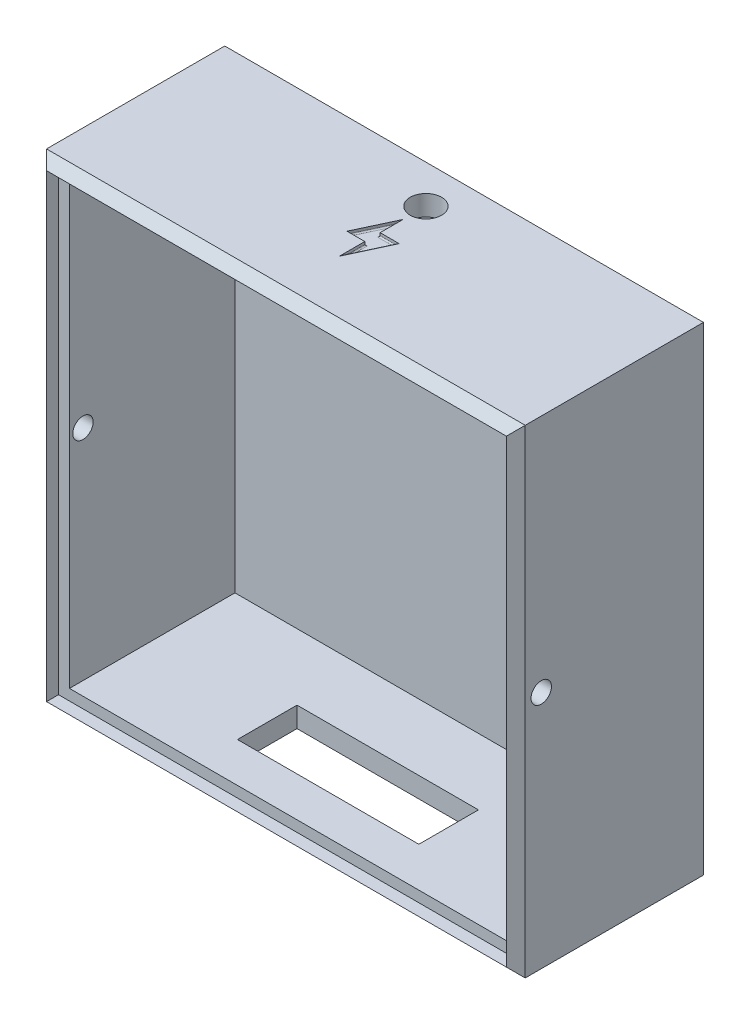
ISO-10303-21;
HEADER;
FILE_DESCRIPTION(('STEP AP214'),'2;1');
FILE_NAME('part.step','',(''),(''),'','','');
FILE_SCHEMA(('AUTOMOTIVE_DESIGN { 1 0 10303 214 1 1 1 1 }'));
ENDSEC;
DATA;
#1=APPLICATION_CONTEXT('core data for automotive mechanical design processes');
#2=APPLICATION_PROTOCOL_DEFINITION('international standard','automotive_design',2000,#1);
#3=PRODUCT_CONTEXT('',#1,'mechanical');
#4=PRODUCT('Part','Part','',(#3));
#5=PRODUCT_RELATED_PRODUCT_CATEGORY('part','',(#4));
#6=PRODUCT_DEFINITION_FORMATION('','',#4);
#7=PRODUCT_DEFINITION_CONTEXT('part definition',#1,'design');
#8=PRODUCT_DEFINITION('design','',#6,#7);
#9=PRODUCT_DEFINITION_SHAPE('','',#8);
#10=(LENGTH_UNIT() NAMED_UNIT(*) SI_UNIT(.MILLI.,.METRE.));
#11=(NAMED_UNIT(*) PLANE_ANGLE_UNIT() SI_UNIT($,.RADIAN.));
#12=(NAMED_UNIT(*) SI_UNIT($,.STERADIAN.) SOLID_ANGLE_UNIT());
#13=UNCERTAINTY_MEASURE_WITH_UNIT(LENGTH_MEASURE(1.E-05),#10,'distance_accuracy_value','');
#14=(GEOMETRIC_REPRESENTATION_CONTEXT(3) GLOBAL_UNCERTAINTY_ASSIGNED_CONTEXT((#13)) GLOBAL_UNIT_ASSIGNED_CONTEXT((#10,
#11,#12)) REPRESENTATION_CONTEXT('',''));
#15=CARTESIAN_POINT('',(0.,0.,0.));
#16=DIRECTION('',(0.,0.,1.));
#17=DIRECTION('',(1.,0.,0.));
#18=AXIS2_PLACEMENT_3D('',#15,#16,#17);
#19=CARTESIAN_POINT('',(0.,-92.5,0.));
#20=DIRECTION('',(0.,1.,0.));
#21=DIRECTION('',(0.,0.,1.));
#22=AXIS2_PLACEMENT_3D('',#19,#20,#21);
#23=PLANE('',#22);
#24=CARTESIAN_POINT('',(74.6275371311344,-92.5,28.3));
#25=DIRECTION('',(0.,1.,0.));
#26=DIRECTION('',(0.,0.,1.));
#27=AXIS2_PLACEMENT_3D('',#24,#25,#26);
#28=CIRCLE('',#27,1.79999999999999);
#29=CARTESIAN_POINT('',(74.6275371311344,-92.5,30.1));
#30=VERTEX_POINT('',#29);
#31=EDGE_CURVE('E703',#30,#30,#28,.T.);
#32=ORIENTED_EDGE('',*,*,#31,.T.);
#33=EDGE_LOOP('',(#32));
#34=FACE_BOUND('',#33,.T.);
#35=DIRECTION('',(0.,0.,-1.));
#36=VECTOR('',#35,1.);
#37=CARTESIAN_POINT('',(52.1275371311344,-92.5,25.));
#38=LINE('',#37,#36);
#39=CARTESIAN_POINT('',(52.1275371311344,-92.5,36.5));
#40=VERTEX_POINT('',#39);
#41=CARTESIAN_POINT('',(52.1275371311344,-92.5,25.5));
#42=VERTEX_POINT('',#41);
#43=EDGE_CURVE('E698',#40,#42,#38,.T.);
#44=ORIENTED_EDGE('',*,*,#43,.T.);
#45=DIRECTION('',(1.,0.,0.));
#46=VECTOR('',#45,1.);
#47=CARTESIAN_POINT('',(81.6275371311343,-92.5,25.5));
#48=LINE('',#47,#46);
#49=CARTESIAN_POINT('',(81.1275371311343,-92.5,25.5));
#50=VERTEX_POINT('',#49);
#51=EDGE_CURVE('E700',#42,#50,#48,.T.);
#52=ORIENTED_EDGE('',*,*,#51,.T.);
#53=DIRECTION('',(0.,0.,1.));
#54=VECTOR('',#53,1.);
#55=CARTESIAN_POINT('',(81.1275371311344,-92.5,37.));
#56=LINE('',#55,#54);
#57=CARTESIAN_POINT('',(81.1275371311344,-92.5,36.5));
#58=VERTEX_POINT('',#57);
#59=EDGE_CURVE('E694',#50,#58,#56,.T.);
#60=ORIENTED_EDGE('',*,*,#59,.T.);
#61=DIRECTION('',(-1.,0.,0.));
#62=VECTOR('',#61,1.);
#63=CARTESIAN_POINT('',(51.6275371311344,-92.5,36.5));
#64=LINE('',#63,#62);
#65=EDGE_CURVE('E696',#58,#40,#64,.T.);
#66=ORIENTED_EDGE('',*,*,#65,.T.);
#67=EDGE_LOOP('',(#44,#52,#60,#66));
#68=FACE_BOUND('',#67,.T.);
#69=CARTESIAN_POINT('',(74.6275371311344,-92.5,33.7));
#70=DIRECTION('',(0.,1.,0.));
#71=DIRECTION('',(0.,0.,1.));
#72=AXIS2_PLACEMENT_3D('',#69,#70,#71);
#73=CIRCLE('',#72,1.79999999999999);
#74=CARTESIAN_POINT('',(74.6275371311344,-92.5,35.5));
#75=VERTEX_POINT('',#74);
#76=EDGE_CURVE('E691',#75,#75,#73,.T.);
#77=ORIENTED_EDGE('',*,*,#76,.T.);
#78=EDGE_LOOP('',(#77));
#79=FACE_BOUND('',#78,.T.);
#80=CARTESIAN_POINT('',(77.3275371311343,-92.5,31.));
#81=DIRECTION('',(0.,1.,0.));
#82=DIRECTION('',(0.,0.,1.));
#83=AXIS2_PLACEMENT_3D('',#80,#81,#82);
#84=CIRCLE('',#83,1.79999999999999);
#85=CARTESIAN_POINT('',(77.3275371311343,-92.5,32.8));
#86=VERTEX_POINT('',#85);
#87=EDGE_CURVE('E688',#86,#86,#84,.T.);
#88=ORIENTED_EDGE('',*,*,#87,.T.);
#89=EDGE_LOOP('',(#88));
#90=FACE_BOUND('',#89,.T.);
#91=CARTESIAN_POINT('',(71.9275371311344,-92.5,31.));
#92=DIRECTION('',(0.,1.,0.));
#93=DIRECTION('',(0.,0.,1.));
#94=AXIS2_PLACEMENT_3D('',#91,#92,#93);
#95=CIRCLE('',#94,1.79999999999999);
#96=CARTESIAN_POINT('',(71.9275371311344,-92.5,32.8));
#97=VERTEX_POINT('',#96);
#98=EDGE_CURVE('E685',#97,#97,#95,.T.);
#99=ORIENTED_EDGE('',*,*,#98,.T.);
#100=EDGE_LOOP('',(#99));
#101=FACE_BOUND('',#100,.T.);
#102=DIRECTION('',(0.,0.,1.));
#103=VECTOR('',#102,1.);
#104=CARTESIAN_POINT('',(60.3775371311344,-92.5,0.));
#105=LINE('',#104,#103);
#106=CARTESIAN_POINT('',(60.3775371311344,-92.5,35.5));
#107=VERTEX_POINT('',#106);
#108=CARTESIAN_POINT('',(60.3775371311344,-92.5,32.75));
#109=VERTEX_POINT('',#108);
#110=EDGE_CURVE('E680',#107,#109,#105,.F.);
#111=ORIENTED_EDGE('',*,*,#110,.T.);
#112=DIRECTION('',(1.,0.,0.));
#113=VECTOR('',#112,1.);
#114=CARTESIAN_POINT('',(62.6275371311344,-92.5,32.75));
#115=LINE('',#114,#113);
#116=CARTESIAN_POINT('',(63.1275371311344,-92.5,32.75));
#117=VERTEX_POINT('',#116);
#118=EDGE_CURVE('E682',#109,#117,#115,.T.);
#119=ORIENTED_EDGE('',*,*,#118,.T.);
#120=DIRECTION('',(0.,0.,1.));
#121=VECTOR('',#120,1.);
#122=CARTESIAN_POINT('',(63.1275371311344,-92.5,0.));
#123=LINE('',#122,#121);
#124=CARTESIAN_POINT('',(63.1275371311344,-92.5,29.25));
#125=VERTEX_POINT('',#124);
#126=EDGE_CURVE('E652',#117,#125,#123,.F.);
#127=ORIENTED_EDGE('',*,*,#126,.T.);
#128=DIRECTION('',(1.,0.,0.));
#129=VECTOR('',#128,1.);
#130=CARTESIAN_POINT('',(0.,-92.5,29.25));
#131=LINE('',#130,#129);
#132=CARTESIAN_POINT('',(60.3775371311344,-92.5,29.25));
#133=VERTEX_POINT('',#132);
#134=EDGE_CURVE('E662',#125,#133,#131,.F.);
#135=ORIENTED_EDGE('',*,*,#134,.T.);
#136=DIRECTION('',(0.,0.,1.));
#137=VECTOR('',#136,1.);
#138=CARTESIAN_POINT('',(60.3775371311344,-92.5,0.));
#139=LINE('',#138,#137);
#140=CARTESIAN_POINT('',(60.3775371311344,-92.5,26.5));
#141=VERTEX_POINT('',#140);
#142=EDGE_CURVE('E664',#133,#141,#139,.F.);
#143=ORIENTED_EDGE('',*,*,#142,.T.);
#144=DIRECTION('',(1.,0.,0.));
#145=VECTOR('',#144,1.);
#146=CARTESIAN_POINT('',(0.,-92.5,26.5));
#147=LINE('',#146,#145);
#148=CARTESIAN_POINT('',(56.8775371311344,-92.5,26.5));
#149=VERTEX_POINT('',#148);
#150=EDGE_CURVE('E666',#141,#149,#147,.F.);
#151=ORIENTED_EDGE('',*,*,#150,.T.);
#152=DIRECTION('',(0.,0.,1.));
#153=VECTOR('',#152,1.);
#154=CARTESIAN_POINT('',(56.8775371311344,-92.5,29.75));
#155=LINE('',#154,#153);
#156=CARTESIAN_POINT('',(56.8775371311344,-92.5,29.25));
#157=VERTEX_POINT('',#156);
#158=EDGE_CURVE('E668',#149,#157,#155,.T.);
#159=ORIENTED_EDGE('',*,*,#158,.T.);
#160=DIRECTION('',(1.,0.,0.));
#161=VECTOR('',#160,1.);
#162=CARTESIAN_POINT('',(0.,-92.5,29.25));
#163=LINE('',#162,#161);
#164=CARTESIAN_POINT('',(54.1275371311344,-92.5,29.25));
#165=VERTEX_POINT('',#164);
#166=EDGE_CURVE('E670',#157,#165,#163,.F.);
#167=ORIENTED_EDGE('',*,*,#166,.T.);
#168=DIRECTION('',(0.,0.,1.));
#169=VECTOR('',#168,1.);
#170=CARTESIAN_POINT('',(54.1275371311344,-92.5,32.25));
#171=LINE('',#170,#169);
#172=CARTESIAN_POINT('',(54.1275371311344,-92.5,32.75));
#173=VERTEX_POINT('',#172);
#174=EDGE_CURVE('E672',#165,#173,#171,.T.);
#175=ORIENTED_EDGE('',*,*,#174,.T.);
#176=DIRECTION('',(1.,0.,0.));
#177=VECTOR('',#176,1.);
#178=CARTESIAN_POINT('',(57.3775371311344,-92.5,32.75));
#179=LINE('',#178,#177);
#180=CARTESIAN_POINT('',(56.8775371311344,-92.5,32.75));
#181=VERTEX_POINT('',#180);
#182=EDGE_CURVE('E674',#173,#181,#179,.T.);
#183=ORIENTED_EDGE('',*,*,#182,.T.);
#184=DIRECTION('',(0.,0.,1.));
#185=VECTOR('',#184,1.);
#186=CARTESIAN_POINT('',(56.8775371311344,-92.5,35.));
#187=LINE('',#186,#185);
#188=CARTESIAN_POINT('',(56.8775371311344,-92.5,35.5));
#189=VERTEX_POINT('',#188);
#190=EDGE_CURVE('E676',#181,#189,#187,.T.);
#191=ORIENTED_EDGE('',*,*,#190,.T.);
#192=DIRECTION('',(1.,0.,0.));
#193=VECTOR('',#192,1.);
#194=CARTESIAN_POINT('',(59.8775371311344,-92.5,35.5));
#195=LINE('',#194,#193);
#196=EDGE_CURVE('E678',#189,#107,#195,.T.);
#197=ORIENTED_EDGE('',*,*,#196,.T.);
#198=EDGE_LOOP('',(#111,#119,#127,#135,#143,#151,#159,#167,#175,#183,#191,#197));
#199=FACE_BOUND('',#198,.T.);
#200=ADVANCED_FACE('F40',(#34,#68,#79,#90,#101,#199),#23,.F.);
#201=CARTESIAN_POINT('',(94.,-94.,4.));
#202=DIRECTION('',(-1.,0.,0.));
#203=DIRECTION('',(0.,0.,1.));
#204=AXIS2_PLACEMENT_3D('',#201,#202,#203);
#205=PLANE('',#204);
#206=CARTESIAN_POINT('',(94.,0.,63.6999999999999));
#207=DIRECTION('',(1.,0.,0.));
#208=DIRECTION('',(0.,0.,-1.));
#209=AXIS2_PLACEMENT_3D('',#206,#207,#208);
#210=CIRCLE('',#209,4.00000000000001);
#211=CARTESIAN_POINT('',(94.,0.,59.6999999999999));
#212=VERTEX_POINT('',#211);
#213=EDGE_CURVE('E486',#212,#212,#210,.T.);
#214=ORIENTED_EDGE('',*,*,#213,.F.);
#215=EDGE_LOOP('',(#214));
#216=FACE_BOUND('',#215,.T.);
#217=DIRECTION('',(0.,0.,-1.));
#218=VECTOR('',#217,1.);
#219=CARTESIAN_POINT('',(94.,94.,4.));
#220=LINE('',#219,#218);
#221=CARTESIAN_POINT('',(94.,94.,70.));
#222=VERTEX_POINT('',#221);
#223=CARTESIAN_POINT('',(94.,94.,0.));
#224=VERTEX_POINT('',#223);
#225=EDGE_CURVE('E586',#222,#224,#220,.T.);
#226=ORIENTED_EDGE('',*,*,#225,.F.);
#227=DIRECTION('',(0.,-1.,0.));
#228=VECTOR('',#227,1.);
#229=CARTESIAN_POINT('',(94.,-94.,70.));
#230=LINE('',#229,#228);
#231=CARTESIAN_POINT('',(94.,-94.,70.));
#232=VERTEX_POINT('',#231);
#233=EDGE_CURVE('E607',#222,#232,#230,.T.);
#234=ORIENTED_EDGE('',*,*,#233,.T.);
#235=DIRECTION('',(0.,0.,-1.));
#236=VECTOR('',#235,1.);
#237=CARTESIAN_POINT('',(94.,-94.,4.));
#238=LINE('',#237,#236);
#239=CARTESIAN_POINT('',(94.,-94.,0.));
#240=VERTEX_POINT('',#239);
#241=EDGE_CURVE('E580',#232,#240,#238,.T.);
#242=ORIENTED_EDGE('',*,*,#241,.T.);
#243=DIRECTION('',(0.,1.,0.));
#244=VECTOR('',#243,1.);
#245=CARTESIAN_POINT('',(94.,-94.,0.));
#246=LINE('',#245,#244);
#247=EDGE_CURVE('E568',#240,#224,#246,.T.);
#248=ORIENTED_EDGE('',*,*,#247,.T.);
#249=EDGE_LOOP('',(#226,#234,#242,#248));
#250=FACE_BOUND('',#249,.T.);
#251=ADVANCED_FACE('F884',(#216,#250),#205,.F.);
#252=CARTESIAN_POINT('',(-94.,94.,4.));
#253=DIRECTION('',(0.,-1.,0.));
#254=DIRECTION('',(0.,0.,-1.));
#255=AXIS2_PLACEMENT_3D('',#252,#253,#254);
#256=PLANE('',#255);
#257=DIRECTION('',(-1.,0.,0.));
#258=VECTOR('',#257,1.);
#259=CARTESIAN_POINT('',(7.,94.,32.980499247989));
#260=LINE('',#259,#258);
#261=CARTESIAN_POINT('',(7.5517004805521,94.,32.980499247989));
#262=VERTEX_POINT('',#261);
#263=CARTESIAN_POINT('',(0.,94.,32.980499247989));
#264=VERTEX_POINT('',#263);
#265=EDGE_CURVE('E57',#262,#264,#260,.T.);
#266=ORIENTED_EDGE('',*,*,#265,.F.);
#267=DIRECTION('',(0.422658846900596,0.,-0.906288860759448));
#268=VECTOR('',#267,1.);
#269=CARTESIAN_POINT('',(0.51146320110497,94.,48.0765718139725));
#270=LINE('',#269,#268);
#271=CARTESIAN_POINT('',(0.,94.,49.1732799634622));
#272=VERTEX_POINT('',#271);
#273=EDGE_CURVE('E813',#262,#272,#270,.F.);
#274=ORIENTED_EDGE('',*,*,#273,.T.);
#275=DIRECTION('',(0.,0.,1.));
#276=VECTOR('',#275,1.);
#277=CARTESIAN_POINT('',(0.,94.,38.9902927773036));
#278=LINE('',#277,#276);
#279=CARTESIAN_POINT('',(0.,94.,38.9902927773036));
#280=VERTEX_POINT('',#279);
#281=EDGE_CURVE('E64',#280,#272,#278,.T.);
#282=ORIENTED_EDGE('',*,*,#281,.F.);
#283=DIRECTION('',(1.,0.,0.));
#284=VECTOR('',#283,1.);
#285=CARTESIAN_POINT('',(-7.,94.,38.9902927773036));
#286=LINE('',#285,#284);
#287=CARTESIAN_POINT('',(-7.,94.,38.9902927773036));
#288=VERTEX_POINT('',#287);
#289=EDGE_CURVE('E381',#288,#280,#286,.T.);
#290=ORIENTED_EDGE('',*,*,#289,.F.);
#291=DIRECTION('',(-0.422658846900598,0.,0.906288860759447));
#292=VECTOR('',#291,1.);
#293=CARTESIAN_POINT('',(0.,94.,23.980499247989));
#294=LINE('',#293,#292);
#295=CARTESIAN_POINT('',(0.,94.,23.980499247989));
#296=VERTEX_POINT('',#295);
#297=EDGE_CURVE('E379',#296,#288,#294,.T.);
#298=ORIENTED_EDGE('',*,*,#297,.F.);
#299=DIRECTION('',(0.,0.,-1.));
#300=VECTOR('',#299,1.);
#301=CARTESIAN_POINT('',(0.,94.,32.980499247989));
#302=LINE('',#301,#300);
#303=EDGE_CURVE('E362',#264,#296,#302,.T.);
#304=ORIENTED_EDGE('',*,*,#303,.F.);
#305=EDGE_LOOP('',(#266,#274,#282,#290,#298,#304));
#306=FACE_BOUND('',#305,.T.);
#307=CARTESIAN_POINT('',(0.,94.,15.));
#308=DIRECTION('',(0.,1.,0.));
#309=DIRECTION('',(0.,0.,1.));
#310=AXIS2_PLACEMENT_3D('',#307,#308,#309);
#311=CIRCLE('',#310,6.15);
#312=CARTESIAN_POINT('',(0.,94.,21.15));
#313=VERTEX_POINT('',#312);
#314=EDGE_CURVE('E482',#313,#313,#311,.T.);
#315=ORIENTED_EDGE('',*,*,#314,.F.);
#316=EDGE_LOOP('',(#315));
#317=FACE_BOUND('',#316,.T.);
#318=DIRECTION('',(0.,0.,-1.));
#319=VECTOR('',#318,1.);
#320=CARTESIAN_POINT('',(-94.,94.,4.));
#321=LINE('',#320,#319);
#322=CARTESIAN_POINT('',(-94.,94.,70.));
#323=VERTEX_POINT('',#322);
#324=CARTESIAN_POINT('',(-94.,94.,0.));
#325=VERTEX_POINT('',#324);
#326=EDGE_CURVE('E584',#323,#325,#321,.T.);
#327=ORIENTED_EDGE('',*,*,#326,.F.);
#328=DIRECTION('',(1.,0.,0.));
#329=VECTOR('',#328,1.);
#330=CARTESIAN_POINT('',(-94.,94.,70.));
#331=LINE('',#330,#329);
#332=EDGE_CURVE('E602',#323,#222,#331,.T.);
#333=ORIENTED_EDGE('',*,*,#332,.T.);
#334=ORIENTED_EDGE('',*,*,#225,.T.);
#335=DIRECTION('',(-1.,0.,0.));
#336=VECTOR('',#335,1.);
#337=CARTESIAN_POINT('',(-94.,94.,0.));
#338=LINE('',#337,#336);
#339=EDGE_CURVE('E571',#224,#325,#338,.T.);
#340=ORIENTED_EDGE('',*,*,#339,.T.);
#341=EDGE_LOOP('',(#327,#333,#334,#340));
#342=FACE_BOUND('',#341,.T.);
#343=ADVANCED_FACE('F375',(#306,#317,#342),#256,.F.);
#344=CARTESIAN_POINT('',(-94.,-94.,4.));
#345=DIRECTION('',(1.,0.,0.));
#346=DIRECTION('',(0.,0.,-1.));
#347=AXIS2_PLACEMENT_3D('',#344,#345,#346);
#348=PLANE('',#347);
#349=CARTESIAN_POINT('',(-94.,0.,63.6999999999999));
#350=DIRECTION('',(1.,0.,0.));
#351=DIRECTION('',(0.,0.,-1.));
#352=AXIS2_PLACEMENT_3D('',#349,#350,#351);
#353=CIRCLE('',#352,4.00000000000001);
#354=CARTESIAN_POINT('',(-94.,0.,59.6999999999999));
#355=VERTEX_POINT('',#354);
#356=EDGE_CURVE('E493',#355,#355,#353,.T.);
#357=ORIENTED_EDGE('',*,*,#356,.T.);
#358=EDGE_LOOP('',(#357));
#359=FACE_BOUND('',#358,.T.);
#360=DIRECTION('',(0.,0.,-1.));
#361=VECTOR('',#360,1.);
#362=CARTESIAN_POINT('',(-94.,-94.,4.));
#363=LINE('',#362,#361);
#364=CARTESIAN_POINT('',(-94.,-94.,70.));
#365=VERTEX_POINT('',#364);
#366=CARTESIAN_POINT('',(-94.,-94.,0.));
#367=VERTEX_POINT('',#366);
#368=EDGE_CURVE('E582',#365,#367,#363,.T.);
#369=ORIENTED_EDGE('',*,*,#368,.F.);
#370=DIRECTION('',(0.,1.,0.));
#371=VECTOR('',#370,1.);
#372=CARTESIAN_POINT('',(-94.,-94.,70.));
#373=LINE('',#372,#371);
#374=EDGE_CURVE('E615',#365,#323,#373,.T.);
#375=ORIENTED_EDGE('',*,*,#374,.T.);
#376=ORIENTED_EDGE('',*,*,#326,.T.);
#377=DIRECTION('',(0.,-1.,0.));
#378=VECTOR('',#377,1.);
#379=CARTESIAN_POINT('',(-94.,-94.,0.));
#380=LINE('',#379,#378);
#381=EDGE_CURVE('E574',#325,#367,#380,.T.);
#382=ORIENTED_EDGE('',*,*,#381,.T.);
#383=EDGE_LOOP('',(#369,#375,#376,#382));
#384=FACE_BOUND('',#383,.T.);
#385=ADVANCED_FACE('F977',(#359,#384),#348,.F.);
#386=CARTESIAN_POINT('',(-94.,-94.,4.));
#387=DIRECTION('',(0.,1.,0.));
#388=DIRECTION('',(0.,0.,1.));
#389=AXIS2_PLACEMENT_3D('',#386,#387,#388);
#390=PLANE('',#389);
#391=DIRECTION('',(0.,0.,1.));
#392=VECTOR('',#391,1.);
#393=CARTESIAN_POINT('',(82.6275371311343,-94.,3.9999999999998));
#394=LINE('',#393,#392);
#395=CARTESIAN_POINT('',(82.6275371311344,-94.,38.));
#396=VERTEX_POINT('',#395);
#397=CARTESIAN_POINT('',(82.6275371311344,-94.,24.));
#398=VERTEX_POINT('',#397);
#399=EDGE_CURVE('E638',#396,#398,#394,.F.);
#400=ORIENTED_EDGE('',*,*,#399,.T.);
#401=DIRECTION('',(1.,0.,0.));
#402=VECTOR('',#401,1.);
#403=CARTESIAN_POINT('',(-94.,-94.,24.));
#404=LINE('',#403,#402);
#405=CARTESIAN_POINT('',(50.6275371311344,-94.,24.));
#406=VERTEX_POINT('',#405);
#407=EDGE_CURVE('E640',#398,#406,#404,.F.);
#408=ORIENTED_EDGE('',*,*,#407,.T.);
#409=DIRECTION('',(0.,0.,-1.));
#410=VECTOR('',#409,1.);
#411=CARTESIAN_POINT('',(50.6275371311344,-94.,4.));
#412=LINE('',#411,#410);
#413=CARTESIAN_POINT('',(50.6275371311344,-94.,38.));
#414=VERTEX_POINT('',#413);
#415=EDGE_CURVE('E634',#406,#414,#412,.F.);
#416=ORIENTED_EDGE('',*,*,#415,.T.);
#417=DIRECTION('',(-1.,0.,0.));
#418=VECTOR('',#417,1.);
#419=CARTESIAN_POINT('',(-94.,-94.,38.));
#420=LINE('',#419,#418);
#421=EDGE_CURVE('E636',#414,#396,#420,.F.);
#422=ORIENTED_EDGE('',*,*,#421,.T.);
#423=EDGE_LOOP('',(#400,#408,#416,#422));
#424=FACE_BOUND('',#423,.T.);
#425=CARTESIAN_POINT('',(66.6275371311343,-94.,15.));
#426=DIRECTION('',(0.,-1.,0.));
#427=DIRECTION('',(0.,0.,-1.));
#428=AXIS2_PLACEMENT_3D('',#425,#426,#427);
#429=CIRCLE('',#428,6.15);
#430=CARTESIAN_POINT('',(66.6275371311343,-94.,8.85));
#431=VERTEX_POINT('',#430);
#432=EDGE_CURVE('E477',#431,#431,#429,.T.);
#433=ORIENTED_EDGE('',*,*,#432,.F.);
#434=EDGE_LOOP('',(#433));
#435=FACE_BOUND('',#434,.T.);
#436=DIRECTION('',(-1.,0.,0.));
#437=VECTOR('',#436,1.);
#438=CARTESIAN_POINT('',(-35.625,-94.,53.4));
#439=LINE('',#438,#437);
#440=CARTESIAN_POINT('',(35.625,-94.,53.4));
#441=VERTEX_POINT('',#440);
#442=CARTESIAN_POINT('',(-35.625,-94.,53.4));
#443=VERTEX_POINT('',#442);
#444=EDGE_CURVE('E530',#441,#443,#439,.T.);
#445=ORIENTED_EDGE('',*,*,#444,.F.);
#446=DIRECTION('',(0.,0.,1.));
#447=VECTOR('',#446,1.);
#448=CARTESIAN_POINT('',(35.625,-94.,30.));
#449=LINE('',#448,#447);
#450=CARTESIAN_POINT('',(35.625,-94.,30.));
#451=VERTEX_POINT('',#450);
#452=EDGE_CURVE('E528',#451,#441,#449,.T.);
#453=ORIENTED_EDGE('',*,*,#452,.F.);
#454=DIRECTION('',(1.,0.,0.));
#455=VECTOR('',#454,1.);
#456=CARTESIAN_POINT('',(-35.625,-94.,30.));
#457=LINE('',#456,#455);
#458=CARTESIAN_POINT('',(-35.625,-94.,30.));
#459=VERTEX_POINT('',#458);
#460=EDGE_CURVE('E536',#459,#451,#457,.T.);
#461=ORIENTED_EDGE('',*,*,#460,.F.);
#462=DIRECTION('',(0.,0.,-1.));
#463=VECTOR('',#462,1.);
#464=CARTESIAN_POINT('',(-35.625,-94.,30.));
#465=LINE('',#464,#463);
#466=EDGE_CURVE('E533',#443,#459,#465,.T.);
#467=ORIENTED_EDGE('',*,*,#466,.F.);
#468=EDGE_LOOP('',(#445,#453,#461,#467));
#469=FACE_BOUND('',#468,.T.);
#470=ORIENTED_EDGE('',*,*,#241,.F.);
#471=DIRECTION('',(-1.,0.,0.));
#472=VECTOR('',#471,1.);
#473=CARTESIAN_POINT('',(-94.,-94.,70.));
#474=LINE('',#473,#472);
#475=EDGE_CURVE('E611',#232,#365,#474,.T.);
#476=ORIENTED_EDGE('',*,*,#475,.T.);
#477=ORIENTED_EDGE('',*,*,#368,.T.);
#478=DIRECTION('',(1.,0.,0.));
#479=VECTOR('',#478,1.);
#480=CARTESIAN_POINT('',(-94.,-94.,0.));
#481=LINE('',#480,#479);
#482=EDGE_CURVE('E577',#367,#240,#481,.T.);
#483=ORIENTED_EDGE('',*,*,#482,.T.);
#484=EDGE_LOOP('',(#470,#476,#477,#483));
#485=FACE_BOUND('',#484,.T.);
#486=ADVANCED_FACE('F973',(#424,#435,#469,#485),#390,.F.);
#487=CARTESIAN_POINT('',(0.,0.,0.));
#488=DIRECTION('',(0.,0.,-1.));
#489=DIRECTION('',(-1.,0.,0.));
#490=AXIS2_PLACEMENT_3D('',#487,#488,#489);
#491=PLANE('',#490);
#492=ORIENTED_EDGE('',*,*,#247,.F.);
#493=ORIENTED_EDGE('',*,*,#482,.F.);
#494=ORIENTED_EDGE('',*,*,#381,.F.);
#495=ORIENTED_EDGE('',*,*,#339,.F.);
#496=EDGE_LOOP('',(#492,#493,#494,#495));
#497=FACE_BOUND('',#496,.T.);
#498=ADVANCED_FACE('F966',(#497),#491,.T.);
#499=CARTESIAN_POINT('',(86.,-86.,74.));
#500=DIRECTION('',(-1.,0.,0.));
#501=DIRECTION('',(0.,0.,1.));
#502=AXIS2_PLACEMENT_3D('',#499,#500,#501);
#503=PLANE('',#502);
#504=CARTESIAN_POINT('',(86.,0.,63.6999999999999));
#505=DIRECTION('',(-1.,0.,0.));
#506=DIRECTION('',(0.,0.,1.));
#507=AXIS2_PLACEMENT_3D('',#504,#505,#506);
#508=CIRCLE('',#507,4.00000000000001);
#509=CARTESIAN_POINT('',(86.,0.,67.6999999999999));
#510=VERTEX_POINT('',#509);
#511=EDGE_CURVE('E490',#510,#510,#508,.T.);
#512=ORIENTED_EDGE('',*,*,#511,.F.);
#513=EDGE_LOOP('',(#512));
#514=FACE_BOUND('',#513,.T.);
#515=DIRECTION('',(0.,-1.,0.));
#516=VECTOR('',#515,1.);
#517=CARTESIAN_POINT('',(86.,-86.,69.));
#518=LINE('',#517,#516);
#519=CARTESIAN_POINT('',(86.,86.,69.));
#520=VERTEX_POINT('',#519);
#521=CARTESIAN_POINT('',(86.,-86.,69.));
#522=VERTEX_POINT('',#521);
#523=EDGE_CURVE('E526',#520,#522,#518,.T.);
#524=ORIENTED_EDGE('',*,*,#523,.F.);
#525=DIRECTION('',(0.,0.,-1.));
#526=VECTOR('',#525,1.);
#527=CARTESIAN_POINT('',(86.,86.,74.));
#528=LINE('',#527,#526);
#529=CARTESIAN_POINT('',(86.,86.,4.));
#530=VERTEX_POINT('',#529);
#531=EDGE_CURVE('E566',#520,#530,#528,.T.);
#532=ORIENTED_EDGE('',*,*,#531,.T.);
#533=DIRECTION('',(0.,1.,0.));
#534=VECTOR('',#533,1.);
#535=CARTESIAN_POINT('',(86.,-86.,4.));
#536=LINE('',#535,#534);
#537=CARTESIAN_POINT('',(86.,-86.,4.));
#538=VERTEX_POINT('',#537);
#539=EDGE_CURVE('E542',#538,#530,#536,.T.);
#540=ORIENTED_EDGE('',*,*,#539,.F.);
#541=DIRECTION('',(0.,0.,-1.));
#542=VECTOR('',#541,1.);
#543=CARTESIAN_POINT('',(86.,-86.,74.));
#544=LINE('',#543,#542);
#545=EDGE_CURVE('E560',#522,#538,#544,.T.);
#546=ORIENTED_EDGE('',*,*,#545,.F.);
#547=EDGE_LOOP('',(#524,#532,#540,#546));
#548=FACE_BOUND('',#547,.T.);
#549=ADVANCED_FACE('F962',(#514,#548),#503,.T.);
#550=CARTESIAN_POINT('',(-86.,86.,74.));
#551=DIRECTION('',(0.,-1.,0.));
#552=DIRECTION('',(0.,0.,-1.));
#553=AXIS2_PLACEMENT_3D('',#550,#551,#552);
#554=PLANE('',#553);
#555=CARTESIAN_POINT('',(0.,86.,15.));
#556=DIRECTION('',(0.,-1.,0.));
#557=DIRECTION('',(0.,0.,-1.));
#558=AXIS2_PLACEMENT_3D('',#555,#556,#557);
#559=CIRCLE('',#558,6.15);
#560=CARTESIAN_POINT('',(0.,86.,8.85));
#561=VERTEX_POINT('',#560);
#562=EDGE_CURVE('E485',#561,#561,#559,.T.);
#563=ORIENTED_EDGE('',*,*,#562,.F.);
#564=EDGE_LOOP('',(#563));
#565=FACE_BOUND('',#564,.T.);
#566=DIRECTION('',(1.,0.,0.));
#567=VECTOR('',#566,1.);
#568=CARTESIAN_POINT('',(-86.,86.,69.));
#569=LINE('',#568,#567);
#570=CARTESIAN_POINT('',(-86.,86.,69.));
#571=VERTEX_POINT('',#570);
#572=EDGE_CURVE('E524',#571,#520,#569,.T.);
#573=ORIENTED_EDGE('',*,*,#572,.F.);
#574=DIRECTION('',(0.,0.,-1.));
#575=VECTOR('',#574,1.);
#576=CARTESIAN_POINT('',(-86.,86.,74.));
#577=LINE('',#576,#575);
#578=CARTESIAN_POINT('',(-86.,86.,4.));
#579=VERTEX_POINT('',#578);
#580=EDGE_CURVE('E564',#571,#579,#577,.T.);
#581=ORIENTED_EDGE('',*,*,#580,.T.);
#582=DIRECTION('',(-1.,0.,0.));
#583=VECTOR('',#582,1.);
#584=CARTESIAN_POINT('',(-86.,86.,4.));
#585=LINE('',#584,#583);
#586=EDGE_CURVE('E551',#530,#579,#585,.T.);
#587=ORIENTED_EDGE('',*,*,#586,.F.);
#588=ORIENTED_EDGE('',*,*,#531,.F.);
#589=EDGE_LOOP('',(#573,#581,#587,#588));
#590=FACE_BOUND('',#589,.T.);
#591=ADVANCED_FACE('F958',(#565,#590),#554,.T.);
#592=CARTESIAN_POINT('',(-86.,-86.,74.));
#593=DIRECTION('',(1.,0.,0.));
#594=DIRECTION('',(0.,0.,-1.));
#595=AXIS2_PLACEMENT_3D('',#592,#593,#594);
#596=PLANE('',#595);
#597=CARTESIAN_POINT('',(-86.,0.,63.6999999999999));
#598=DIRECTION('',(1.,0.,0.));
#599=DIRECTION('',(0.,0.,-1.));
#600=AXIS2_PLACEMENT_3D('',#597,#598,#599);
#601=CIRCLE('',#600,4.00000000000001);
#602=CARTESIAN_POINT('',(-86.,0.,59.6999999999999));
#603=VERTEX_POINT('',#602);
#604=EDGE_CURVE('E489',#603,#603,#601,.T.);
#605=ORIENTED_EDGE('',*,*,#604,.F.);
#606=EDGE_LOOP('',(#605));
#607=FACE_BOUND('',#606,.T.);
#608=DIRECTION('',(0.,1.,0.));
#609=VECTOR('',#608,1.);
#610=CARTESIAN_POINT('',(-86.,-86.,69.));
#611=LINE('',#610,#609);
#612=CARTESIAN_POINT('',(-86.,-86.,69.));
#613=VERTEX_POINT('',#612);
#614=EDGE_CURVE('E514',#613,#571,#611,.T.);
#615=ORIENTED_EDGE('',*,*,#614,.F.);
#616=DIRECTION('',(0.,0.,-1.));
#617=VECTOR('',#616,1.);
#618=CARTESIAN_POINT('',(-86.,-86.,74.));
#619=LINE('',#618,#617);
#620=CARTESIAN_POINT('',(-86.,-86.,4.));
#621=VERTEX_POINT('',#620);
#622=EDGE_CURVE('E562',#613,#621,#619,.T.);
#623=ORIENTED_EDGE('',*,*,#622,.T.);
#624=DIRECTION('',(0.,-1.,0.));
#625=VECTOR('',#624,1.);
#626=CARTESIAN_POINT('',(-86.,-86.,4.));
#627=LINE('',#626,#625);
#628=EDGE_CURVE('E554',#579,#621,#627,.T.);
#629=ORIENTED_EDGE('',*,*,#628,.F.);
#630=ORIENTED_EDGE('',*,*,#580,.F.);
#631=EDGE_LOOP('',(#615,#623,#629,#630));
#632=FACE_BOUND('',#631,.T.);
#633=ADVANCED_FACE('F954',(#607,#632),#596,.T.);
#634=CARTESIAN_POINT('',(-86.,-86.,74.));
#635=DIRECTION('',(0.,1.,0.));
#636=DIRECTION('',(0.,0.,1.));
#637=AXIS2_PLACEMENT_3D('',#634,#635,#636);
#638=PLANE('',#637);
#639=CARTESIAN_POINT('',(66.6275371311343,-86.,15.));
#640=DIRECTION('',(0.,1.,0.));
#641=DIRECTION('',(0.,0.,1.));
#642=AXIS2_PLACEMENT_3D('',#639,#640,#641);
#643=CIRCLE('',#642,6.15);
#644=CARTESIAN_POINT('',(66.6275371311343,-86.,21.15));
#645=VERTEX_POINT('',#644);
#646=EDGE_CURVE('E480',#645,#645,#643,.T.);
#647=ORIENTED_EDGE('',*,*,#646,.F.);
#648=EDGE_LOOP('',(#647));
#649=FACE_BOUND('',#648,.T.);
#650=DIRECTION('',(-1.,0.,0.));
#651=VECTOR('',#650,1.);
#652=CARTESIAN_POINT('',(-86.,-86.,69.));
#653=LINE('',#652,#651);
#654=EDGE_CURVE('E597',#522,#613,#653,.T.);
#655=ORIENTED_EDGE('',*,*,#654,.F.);
#656=ORIENTED_EDGE('',*,*,#545,.T.);
#657=DIRECTION('',(1.,0.,0.));
#658=VECTOR('',#657,1.);
#659=CARTESIAN_POINT('',(-86.,-86.,4.));
#660=LINE('',#659,#658);
#661=EDGE_CURVE('E557',#621,#538,#660,.T.);
#662=ORIENTED_EDGE('',*,*,#661,.F.);
#663=ORIENTED_EDGE('',*,*,#622,.F.);
#664=EDGE_LOOP('',(#655,#656,#662,#663));
#665=FACE_BOUND('',#664,.T.);
#666=DIRECTION('',(0.,0.,-1.));
#667=VECTOR('',#666,1.);
#668=CARTESIAN_POINT('',(35.625,-86.,74.));
#669=LINE('',#668,#667);
#670=CARTESIAN_POINT('',(35.625,-86.,53.4));
#671=VERTEX_POINT('',#670);
#672=CARTESIAN_POINT('',(35.625,-86.,30.));
#673=VERTEX_POINT('',#672);
#674=EDGE_CURVE('E595',#671,#673,#669,.T.);
#675=ORIENTED_EDGE('',*,*,#674,.F.);
#676=DIRECTION('',(1.,0.,0.));
#677=VECTOR('',#676,1.);
#678=CARTESIAN_POINT('',(-86.,-86.,53.4));
#679=LINE('',#678,#677);
#680=CARTESIAN_POINT('',(-35.625,-86.,53.4));
#681=VERTEX_POINT('',#680);
#682=EDGE_CURVE('E588',#681,#671,#679,.T.);
#683=ORIENTED_EDGE('',*,*,#682,.F.);
#684=DIRECTION('',(0.,0.,1.));
#685=VECTOR('',#684,1.);
#686=CARTESIAN_POINT('',(-35.625,-86.,74.));
#687=LINE('',#686,#685);
#688=CARTESIAN_POINT('',(-35.625,-86.,30.));
#689=VERTEX_POINT('',#688);
#690=EDGE_CURVE('E590',#689,#681,#687,.T.);
#691=ORIENTED_EDGE('',*,*,#690,.F.);
#692=DIRECTION('',(-1.,0.,0.));
#693=VECTOR('',#692,1.);
#694=CARTESIAN_POINT('',(-86.,-86.,30.));
#695=LINE('',#694,#693);
#696=EDGE_CURVE('E593',#673,#689,#695,.T.);
#697=ORIENTED_EDGE('',*,*,#696,.F.);
#698=EDGE_LOOP('',(#675,#683,#691,#697));
#699=FACE_BOUND('',#698,.T.);
#700=ADVANCED_FACE('F951',(#649,#665,#699),#638,.T.);
#701=CARTESIAN_POINT('',(0.,0.,4.));
#702=DIRECTION('',(0.,0.,-1.));
#703=DIRECTION('',(-1.,0.,0.));
#704=AXIS2_PLACEMENT_3D('',#701,#702,#703);
#705=PLANE('',#704);
#706=ORIENTED_EDGE('',*,*,#661,.T.);
#707=ORIENTED_EDGE('',*,*,#539,.T.);
#708=ORIENTED_EDGE('',*,*,#586,.T.);
#709=ORIENTED_EDGE('',*,*,#628,.T.);
#710=EDGE_LOOP('',(#706,#707,#708,#709));
#711=FACE_BOUND('',#710,.T.);
#712=ADVANCED_FACE('F949',(#711),#705,.F.);
#713=CARTESIAN_POINT('',(35.625,-24.,30.));
#714=DIRECTION('',(1.,0.,0.));
#715=DIRECTION('',(0.,0.,-1.));
#716=AXIS2_PLACEMENT_3D('',#713,#714,#715);
#717=PLANE('',#716);
#718=ORIENTED_EDGE('',*,*,#674,.T.);
#719=DIRECTION('',(0.,-1.,0.));
#720=VECTOR('',#719,1.);
#721=CARTESIAN_POINT('',(35.625,-24.,30.));
#722=LINE('',#721,#720);
#723=EDGE_CURVE('E540',#673,#451,#722,.T.);
#724=ORIENTED_EDGE('',*,*,#723,.T.);
#725=ORIENTED_EDGE('',*,*,#452,.T.);
#726=DIRECTION('',(0.,-1.,0.));
#727=VECTOR('',#726,1.);
#728=CARTESIAN_POINT('',(35.625,-24.,53.4));
#729=LINE('',#728,#727);
#730=EDGE_CURVE('E539',#671,#441,#729,.T.);
#731=ORIENTED_EDGE('',*,*,#730,.F.);
#732=EDGE_LOOP('',(#718,#724,#725,#731));
#733=FACE_BOUND('',#732,.T.);
#734=ADVANCED_FACE('F939',(#733),#717,.F.);
#735=CARTESIAN_POINT('',(-35.625,-24.,30.));
#736=DIRECTION('',(0.,0.,-1.));
#737=DIRECTION('',(-1.,0.,0.));
#738=AXIS2_PLACEMENT_3D('',#735,#736,#737);
#739=PLANE('',#738);
#740=ORIENTED_EDGE('',*,*,#696,.T.);
#741=DIRECTION('',(0.,-1.,0.));
#742=VECTOR('',#741,1.);
#743=CARTESIAN_POINT('',(-35.625,-24.,30.));
#744=LINE('',#743,#742);
#745=EDGE_CURVE('E543',#689,#459,#744,.T.);
#746=ORIENTED_EDGE('',*,*,#745,.T.);
#747=ORIENTED_EDGE('',*,*,#460,.T.);
#748=ORIENTED_EDGE('',*,*,#723,.F.);
#749=EDGE_LOOP('',(#740,#746,#747,#748));
#750=FACE_BOUND('',#749,.T.);
#751=ADVANCED_FACE('F935',(#750),#739,.F.);
#752=CARTESIAN_POINT('',(-35.625,-24.,30.));
#753=DIRECTION('',(-1.,0.,0.));
#754=DIRECTION('',(0.,0.,1.));
#755=AXIS2_PLACEMENT_3D('',#752,#753,#754);
#756=PLANE('',#755);
#757=ORIENTED_EDGE('',*,*,#690,.T.);
#758=DIRECTION('',(0.,-1.,0.));
#759=VECTOR('',#758,1.);
#760=CARTESIAN_POINT('',(-35.625,-24.,53.4));
#761=LINE('',#760,#759);
#762=EDGE_CURVE('E545',#681,#443,#761,.T.);
#763=ORIENTED_EDGE('',*,*,#762,.T.);
#764=ORIENTED_EDGE('',*,*,#466,.T.);
#765=ORIENTED_EDGE('',*,*,#745,.F.);
#766=EDGE_LOOP('',(#757,#763,#764,#765));
#767=FACE_BOUND('',#766,.T.);
#768=ADVANCED_FACE('F938',(#767),#756,.F.);
#769=CARTESIAN_POINT('',(-35.625,-24.,53.4));
#770=DIRECTION('',(0.,0.,1.));
#771=DIRECTION('',(1.,0.,0.));
#772=AXIS2_PLACEMENT_3D('',#769,#770,#771);
#773=PLANE('',#772);
#774=ORIENTED_EDGE('',*,*,#682,.T.);
#775=ORIENTED_EDGE('',*,*,#730,.T.);
#776=ORIENTED_EDGE('',*,*,#444,.T.);
#777=ORIENTED_EDGE('',*,*,#762,.F.);
#778=EDGE_LOOP('',(#774,#775,#776,#777));
#779=FACE_BOUND('',#778,.T.);
#780=ADVANCED_FACE('F933',(#779),#773,.F.);
#781=CARTESIAN_POINT('',(90.3,-90.3,69.));
#782=DIRECTION('',(1.,0.,0.));
#783=DIRECTION('',(0.,0.,-1.));
#784=AXIS2_PLACEMENT_3D('',#781,#782,#783);
#785=PLANE('',#784);
#786=DIRECTION('',(0.,0.,1.));
#787=VECTOR('',#786,1.);
#788=CARTESIAN_POINT('',(90.3,-90.3,69.));
#789=LINE('',#788,#787);
#790=CARTESIAN_POINT('',(90.3,-90.3,69.));
#791=VERTEX_POINT('',#790);
#792=CARTESIAN_POINT('',(90.3,-90.3,73.6999999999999));
#793=VERTEX_POINT('',#792);
#794=EDGE_CURVE('E511',#791,#793,#789,.T.);
#795=ORIENTED_EDGE('',*,*,#794,.T.);
#796=DIRECTION('',(0.,-1.,0.));
#797=VECTOR('',#796,1.);
#798=CARTESIAN_POINT('',(90.3,0.,73.6999999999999));
#799=LINE('',#798,#797);
#800=CARTESIAN_POINT('',(90.3,90.3,73.6999999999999));
#801=VERTEX_POINT('',#800);
#802=EDGE_CURVE('E605',#793,#801,#799,.F.);
#803=ORIENTED_EDGE('',*,*,#802,.T.);
#804=DIRECTION('',(0.,0.,1.));
#805=VECTOR('',#804,1.);
#806=CARTESIAN_POINT('',(90.3,90.3,69.));
#807=LINE('',#806,#805);
#808=CARTESIAN_POINT('',(90.3,90.3,69.));
#809=VERTEX_POINT('',#808);
#810=EDGE_CURVE('E510',#809,#801,#807,.T.);
#811=ORIENTED_EDGE('',*,*,#810,.F.);
#812=DIRECTION('',(0.,1.,0.));
#813=VECTOR('',#812,1.);
#814=CARTESIAN_POINT('',(90.3,-90.3,69.));
#815=LINE('',#814,#813);
#816=EDGE_CURVE('E497',#791,#809,#815,.T.);
#817=ORIENTED_EDGE('',*,*,#816,.F.);
#818=EDGE_LOOP('',(#795,#803,#811,#817));
#819=FACE_BOUND('',#818,.T.);
#820=ADVANCED_FACE('F923',(#819),#785,.F.);
#821=CARTESIAN_POINT('',(-90.3,-90.3,69.));
#822=DIRECTION('',(0.,-1.,0.));
#823=DIRECTION('',(0.,0.,-1.));
#824=AXIS2_PLACEMENT_3D('',#821,#822,#823);
#825=PLANE('',#824);
#826=DIRECTION('',(0.,0.,1.));
#827=VECTOR('',#826,1.);
#828=CARTESIAN_POINT('',(-90.3,-90.3,69.));
#829=LINE('',#828,#827);
#830=CARTESIAN_POINT('',(-90.3,-90.3,69.));
#831=VERTEX_POINT('',#830);
#832=CARTESIAN_POINT('',(-90.3,-90.3,73.6999999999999));
#833=VERTEX_POINT('',#832);
#834=EDGE_CURVE('E515',#831,#833,#829,.T.);
#835=ORIENTED_EDGE('',*,*,#834,.T.);
#836=DIRECTION('',(-1.,0.,0.));
#837=VECTOR('',#836,1.);
#838=CARTESIAN_POINT('',(0.,-90.3,73.6999999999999));
#839=LINE('',#838,#837);
#840=EDGE_CURVE('E609',#833,#793,#839,.F.);
#841=ORIENTED_EDGE('',*,*,#840,.T.);
#842=ORIENTED_EDGE('',*,*,#794,.F.);
#843=DIRECTION('',(1.,0.,0.));
#844=VECTOR('',#843,1.);
#845=CARTESIAN_POINT('',(-90.3,-90.3,69.));
#846=LINE('',#845,#844);
#847=EDGE_CURVE('E507',#831,#791,#846,.T.);
#848=ORIENTED_EDGE('',*,*,#847,.F.);
#849=EDGE_LOOP('',(#835,#841,#842,#848));
#850=FACE_BOUND('',#849,.T.);
#851=ADVANCED_FACE('F919',(#850),#825,.F.);
#852=CARTESIAN_POINT('',(-90.3,-90.3,69.));
#853=DIRECTION('',(-1.,0.,0.));
#854=DIRECTION('',(0.,0.,1.));
#855=AXIS2_PLACEMENT_3D('',#852,#853,#854);
#856=PLANE('',#855);
#857=DIRECTION('',(0.,0.,1.));
#858=VECTOR('',#857,1.);
#859=CARTESIAN_POINT('',(-90.3,90.3,69.));
#860=LINE('',#859,#858);
#861=CARTESIAN_POINT('',(-90.3,90.3,69.));
#862=VERTEX_POINT('',#861);
#863=CARTESIAN_POINT('',(-90.3,90.3,73.6999999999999));
#864=VERTEX_POINT('',#863);
#865=EDGE_CURVE('E518',#862,#864,#860,.T.);
#866=ORIENTED_EDGE('',*,*,#865,.T.);
#867=DIRECTION('',(0.,1.,0.));
#868=VECTOR('',#867,1.);
#869=CARTESIAN_POINT('',(-90.3,0.,73.6999999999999));
#870=LINE('',#869,#868);
#871=EDGE_CURVE('E613',#864,#833,#870,.F.);
#872=ORIENTED_EDGE('',*,*,#871,.T.);
#873=ORIENTED_EDGE('',*,*,#834,.F.);
#874=DIRECTION('',(0.,-1.,0.));
#875=VECTOR('',#874,1.);
#876=CARTESIAN_POINT('',(-90.3,-90.3,69.));
#877=LINE('',#876,#875);
#878=EDGE_CURVE('E504',#862,#831,#877,.T.);
#879=ORIENTED_EDGE('',*,*,#878,.F.);
#880=EDGE_LOOP('',(#866,#872,#873,#879));
#881=FACE_BOUND('',#880,.T.);
#882=ADVANCED_FACE('F922',(#881),#856,.F.);
#883=CARTESIAN_POINT('',(-90.3,90.3,69.));
#884=DIRECTION('',(0.,1.,0.));
#885=DIRECTION('',(0.,0.,1.));
#886=AXIS2_PLACEMENT_3D('',#883,#884,#885);
#887=PLANE('',#886);
#888=ORIENTED_EDGE('',*,*,#810,.T.);
#889=DIRECTION('',(1.,0.,0.));
#890=VECTOR('',#889,1.);
#891=CARTESIAN_POINT('',(0.,90.3,73.6999999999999));
#892=LINE('',#891,#890);
#893=EDGE_CURVE('E599',#801,#864,#892,.F.);
#894=ORIENTED_EDGE('',*,*,#893,.T.);
#895=ORIENTED_EDGE('',*,*,#865,.F.);
#896=DIRECTION('',(-1.,0.,0.));
#897=VECTOR('',#896,1.);
#898=CARTESIAN_POINT('',(-90.3,90.3,69.));
#899=LINE('',#898,#897);
#900=EDGE_CURVE('E500',#809,#862,#899,.T.);
#901=ORIENTED_EDGE('',*,*,#900,.F.);
#902=EDGE_LOOP('',(#888,#894,#895,#901));
#903=FACE_BOUND('',#902,.T.);
#904=ADVANCED_FACE('F917',(#903),#887,.F.);
#905=CARTESIAN_POINT('',(0.,0.,69.));
#906=DIRECTION('',(0.,0.,-1.));
#907=DIRECTION('',(-1.,0.,0.));
#908=AXIS2_PLACEMENT_3D('',#905,#906,#907);
#909=PLANE('',#908);
#910=ORIENTED_EDGE('',*,*,#523,.T.);
#911=ORIENTED_EDGE('',*,*,#654,.T.);
#912=ORIENTED_EDGE('',*,*,#614,.T.);
#913=ORIENTED_EDGE('',*,*,#572,.T.);
#914=EDGE_LOOP('',(#910,#911,#912,#913));
#915=FACE_BOUND('',#914,.T.);
#916=ORIENTED_EDGE('',*,*,#816,.T.);
#917=ORIENTED_EDGE('',*,*,#900,.T.);
#918=ORIENTED_EDGE('',*,*,#878,.T.);
#919=ORIENTED_EDGE('',*,*,#847,.T.);
#920=EDGE_LOOP('',(#916,#917,#918,#919));
#921=FACE_BOUND('',#920,.T.);
#922=ADVANCED_FACE('F913',(#915,#921),#909,.F.);
#923=CARTESIAN_POINT('',(0.,-89.9999999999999,74.));
#924=DIRECTION('',(0.,0.707106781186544,-0.707106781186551));
#925=DIRECTION('',(1.,0.,0.));
#926=AXIS2_PLACEMENT_3D('',#923,#924,#925);
#927=PLANE('',#926);
#928=DIRECTION('',(0.577350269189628,0.577350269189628,0.577350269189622));
#929=VECTOR('',#928,1.);
#930=CARTESIAN_POINT('',(-59.9999999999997,-59.9999999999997,104.));
#931=LINE('',#930,#929);
#932=EDGE_CURVE('E621',#365,#833,#931,.T.);
#933=ORIENTED_EDGE('',*,*,#932,.F.);
#934=ORIENTED_EDGE('',*,*,#475,.F.);
#935=DIRECTION('',(-0.577350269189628,0.577350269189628,0.577350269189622));
#936=VECTOR('',#935,1.);
#937=CARTESIAN_POINT('',(59.9999999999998,-59.9999999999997,104.));
#938=LINE('',#937,#936);
#939=EDGE_CURVE('E501',#793,#232,#938,.F.);
#940=ORIENTED_EDGE('',*,*,#939,.F.);
#941=ORIENTED_EDGE('',*,*,#840,.F.);
#942=EDGE_LOOP('',(#933,#934,#940,#941));
#943=FACE_BOUND('',#942,.T.);
#944=ADVANCED_FACE('F916',(#943),#927,.F.);
#945=CARTESIAN_POINT('',(90.,0.,74.));
#946=DIRECTION('',(-0.707106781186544,0.,-0.707106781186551));
#947=DIRECTION('',(0.,1.,0.));
#948=AXIS2_PLACEMENT_3D('',#945,#946,#947);
#949=PLANE('',#948);
#950=ORIENTED_EDGE('',*,*,#939,.T.);
#951=ORIENTED_EDGE('',*,*,#233,.F.);
#952=DIRECTION('',(-0.577350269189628,-0.577350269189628,0.577350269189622));
#953=VECTOR('',#952,1.);
#954=CARTESIAN_POINT('',(59.9999999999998,59.9999999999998,104.));
#955=LINE('',#954,#953);
#956=EDGE_CURVE('E619',#801,#222,#955,.F.);
#957=ORIENTED_EDGE('',*,*,#956,.F.);
#958=ORIENTED_EDGE('',*,*,#802,.F.);
#959=EDGE_LOOP('',(#950,#951,#957,#958));
#960=FACE_BOUND('',#959,.T.);
#961=ADVANCED_FACE('F997',(#960),#949,.F.);
#962=CARTESIAN_POINT('',(-89.9999999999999,0.,74.));
#963=DIRECTION('',(0.707106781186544,0.,-0.707106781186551));
#964=DIRECTION('',(0.,-1.,0.));
#965=AXIS2_PLACEMENT_3D('',#962,#963,#964);
#966=PLANE('',#965);
#967=ORIENTED_EDGE('',*,*,#932,.T.);
#968=ORIENTED_EDGE('',*,*,#871,.F.);
#969=DIRECTION('',(-0.577350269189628,0.577350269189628,-0.577350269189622));
#970=VECTOR('',#969,1.);
#971=CARTESIAN_POINT('',(-59.9999999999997,59.9999999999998,104.));
#972=LINE('',#971,#970);
#973=EDGE_CURVE('E496',#323,#864,#972,.F.);
#974=ORIENTED_EDGE('',*,*,#973,.F.);
#975=ORIENTED_EDGE('',*,*,#374,.F.);
#976=EDGE_LOOP('',(#967,#968,#974,#975));
#977=FACE_BOUND('',#976,.T.);
#978=ADVANCED_FACE('F990',(#977),#966,.F.);
#979=CARTESIAN_POINT('',(0.,89.9999999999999,74.));
#980=DIRECTION('',(0.,-0.707106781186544,-0.707106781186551));
#981=DIRECTION('',(-1.,0.,0.));
#982=AXIS2_PLACEMENT_3D('',#979,#980,#981);
#983=PLANE('',#982);
#984=ORIENTED_EDGE('',*,*,#956,.T.);
#985=ORIENTED_EDGE('',*,*,#332,.F.);
#986=ORIENTED_EDGE('',*,*,#973,.T.);
#987=ORIENTED_EDGE('',*,*,#893,.F.);
#988=EDGE_LOOP('',(#984,#985,#986,#987));
#989=FACE_BOUND('',#988,.T.);
#990=ADVANCED_FACE('F911',(#989),#983,.F.);
#991=CARTESIAN_POINT('',(-227.,0.,63.6999999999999));
#992=DIRECTION('',(1.,0.,0.));
#993=DIRECTION('',(0.,0.,-1.));
#994=AXIS2_PLACEMENT_3D('',#991,#992,#993);
#995=CYLINDRICAL_SURFACE('',#994,4.00000000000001);
#996=ORIENTED_EDGE('',*,*,#604,.T.);
#997=EDGE_LOOP('',(#996));
#998=FACE_BOUND('',#997,.T.);
#999=ORIENTED_EDGE('',*,*,#356,.F.);
#1000=EDGE_LOOP('',(#999));
#1001=FACE_BOUND('',#1000,.T.);
#1002=ADVANCED_FACE('F908',(#998,#1001),#995,.F.);
#1003=ORIENTED_EDGE('',*,*,#511,.T.);
#1004=EDGE_LOOP('',(#1003));
#1005=FACE_BOUND('',#1004,.T.);
#1006=ORIENTED_EDGE('',*,*,#213,.T.);
#1007=EDGE_LOOP('',(#1006));
#1008=FACE_BOUND('',#1007,.T.);
#1009=ADVANCED_FACE('F906',(#1005,#1008),#995,.F.);
#1010=CARTESIAN_POINT('',(0.,64.,15.));
#1011=DIRECTION('',(0.,1.,0.));
#1012=DIRECTION('',(0.,0.,1.));
#1013=AXIS2_PLACEMENT_3D('',#1010,#1011,#1012);
#1014=CYLINDRICAL_SURFACE('',#1013,6.15);
#1015=ORIENTED_EDGE('',*,*,#562,.T.);
#1016=EDGE_LOOP('',(#1015));
#1017=FACE_BOUND('',#1016,.T.);
#1018=ORIENTED_EDGE('',*,*,#314,.T.);
#1019=EDGE_LOOP('',(#1018));
#1020=FACE_BOUND('',#1019,.T.);
#1021=ADVANCED_FACE('F902',(#1017,#1020),#1014,.F.);
#1022=CARTESIAN_POINT('',(66.6275371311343,-64.,15.));
#1023=DIRECTION('',(0.,-1.,0.));
#1024=DIRECTION('',(0.,0.,-1.));
#1025=AXIS2_PLACEMENT_3D('',#1022,#1023,#1024);
#1026=CYLINDRICAL_SURFACE('',#1025,6.15);
#1027=ORIENTED_EDGE('',*,*,#646,.T.);
#1028=EDGE_LOOP('',(#1027));
#1029=FACE_BOUND('',#1028,.T.);
#1030=ORIENTED_EDGE('',*,*,#432,.T.);
#1031=EDGE_LOOP('',(#1030));
#1032=FACE_BOUND('',#1031,.T.);
#1033=ADVANCED_FACE('F899',(#1029,#1032),#1026,.F.);
#1034=CARTESIAN_POINT('',(51.6275371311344,-93.,38.));
#1035=DIRECTION('',(-1.,0.,0.));
#1036=DIRECTION('',(0.,0.,1.));
#1037=AXIS2_PLACEMENT_3D('',#1034,#1035,#1036);
#1038=CYLINDRICAL_SURFACE('',#1037,1.);
#1039=CARTESIAN_POINT('',(82.6275371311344,-93.,38.));
#1040=DIRECTION('',(-0.707106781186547,0.,0.707106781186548));
#1041=DIRECTION('',(0.707106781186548,0.,0.707106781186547));
#1042=AXIS2_PLACEMENT_3D('',#1039,#1040,#1041);
#1043=ELLIPSE('',#1042,1.4142135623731,1.);
#1044=CARTESIAN_POINT('',(81.6275371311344,-93.,37.));
#1045=VERTEX_POINT('',#1044);
#1046=EDGE_CURVE('E656',#396,#1045,#1043,.F.);
#1047=ORIENTED_EDGE('',*,*,#1046,.F.);
#1048=ORIENTED_EDGE('',*,*,#421,.F.);
#1049=CARTESIAN_POINT('',(50.6275371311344,-93.,38.));
#1050=DIRECTION('',(-0.707106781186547,0.,-0.707106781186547));
#1051=DIRECTION('',(-0.707106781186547,0.,0.707106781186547));
#1052=AXIS2_PLACEMENT_3D('',#1049,#1050,#1051);
#1053=ELLIPSE('',#1052,1.41421356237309,1.);
#1054=CARTESIAN_POINT('',(51.6275371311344,-93.,37.));
#1055=VERTEX_POINT('',#1054);
#1056=EDGE_CURVE('E481',#1055,#414,#1053,.T.);
#1057=ORIENTED_EDGE('',*,*,#1056,.F.);
#1058=DIRECTION('',(-1.,0.,0.));
#1059=VECTOR('',#1058,1.);
#1060=CARTESIAN_POINT('',(51.6275371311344,-93.,37.));
#1061=LINE('',#1060,#1059);
#1062=EDGE_CURVE('E646',#1045,#1055,#1061,.T.);
#1063=ORIENTED_EDGE('',*,*,#1062,.F.);
#1064=EDGE_LOOP('',(#1047,#1048,#1057,#1063));
#1065=FACE_BOUND('',#1064,.T.);
#1066=ADVANCED_FACE('F901',(#1065),#1038,.T.);
#1067=CARTESIAN_POINT('',(50.6275371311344,-93.,25.));
#1068=DIRECTION('',(0.,0.,-1.));
#1069=DIRECTION('',(-1.,0.,0.));
#1070=AXIS2_PLACEMENT_3D('',#1067,#1068,#1069);
#1071=CYLINDRICAL_SURFACE('',#1070,1.);
#1072=ORIENTED_EDGE('',*,*,#1056,.T.);
#1073=ORIENTED_EDGE('',*,*,#415,.F.);
#1074=CARTESIAN_POINT('',(50.6275371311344,-93.,24.));
#1075=DIRECTION('',(0.707106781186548,0.,-0.707106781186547));
#1076=DIRECTION('',(0.707106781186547,0.,0.707106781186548));
#1077=AXIS2_PLACEMENT_3D('',#1074,#1075,#1076);
#1078=ELLIPSE('',#1077,1.4142135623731,1.);
#1079=CARTESIAN_POINT('',(51.6275371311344,-93.,25.));
#1080=VERTEX_POINT('',#1079);
#1081=EDGE_CURVE('E654',#1080,#406,#1078,.T.);
#1082=ORIENTED_EDGE('',*,*,#1081,.F.);
#1083=DIRECTION('',(0.,0.,-1.));
#1084=VECTOR('',#1083,1.);
#1085=CARTESIAN_POINT('',(51.6275371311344,-93.,25.));
#1086=LINE('',#1085,#1084);
#1087=EDGE_CURVE('E649',#1055,#1080,#1086,.T.);
#1088=ORIENTED_EDGE('',*,*,#1087,.F.);
#1089=EDGE_LOOP('',(#1072,#1073,#1082,#1088));
#1090=FACE_BOUND('',#1089,.T.);
#1091=ADVANCED_FACE('F1018',(#1090),#1071,.T.);
#1092=CARTESIAN_POINT('',(82.6275371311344,-93.,25.));
#1093=DIRECTION('',(0.,0.,1.));
#1094=DIRECTION('',(1.,0.,0.));
#1095=AXIS2_PLACEMENT_3D('',#1092,#1093,#1094);
#1096=CYLINDRICAL_SURFACE('',#1095,1.);
#1097=ORIENTED_EDGE('',*,*,#1046,.T.);
#1098=DIRECTION('',(0.,0.,1.));
#1099=VECTOR('',#1098,1.);
#1100=CARTESIAN_POINT('',(81.6275371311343,-93.,25.));
#1101=LINE('',#1100,#1099);
#1102=CARTESIAN_POINT('',(81.6275371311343,-93.,25.));
#1103=VERTEX_POINT('',#1102);
#1104=EDGE_CURVE('E643',#1103,#1045,#1101,.T.);
#1105=ORIENTED_EDGE('',*,*,#1104,.F.);
#1106=CARTESIAN_POINT('',(82.6275371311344,-93.,24.));
#1107=DIRECTION('',(0.707106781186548,0.,0.707106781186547));
#1108=DIRECTION('',(0.707106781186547,0.,-0.707106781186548));
#1109=AXIS2_PLACEMENT_3D('',#1106,#1107,#1108);
#1110=ELLIPSE('',#1109,1.41421356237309,1.);
#1111=EDGE_CURVE('E432',#398,#1103,#1110,.F.);
#1112=ORIENTED_EDGE('',*,*,#1111,.F.);
#1113=ORIENTED_EDGE('',*,*,#399,.F.);
#1114=EDGE_LOOP('',(#1097,#1105,#1112,#1113));
#1115=FACE_BOUND('',#1114,.T.);
#1116=ADVANCED_FACE('F1014',(#1115),#1096,.T.);
#1117=CARTESIAN_POINT('',(51.6275371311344,-93.,24.));
#1118=DIRECTION('',(1.,0.,0.));
#1119=DIRECTION('',(0.,0.,-1.));
#1120=AXIS2_PLACEMENT_3D('',#1117,#1118,#1119);
#1121=CYLINDRICAL_SURFACE('',#1120,1.);
#1122=ORIENTED_EDGE('',*,*,#1081,.T.);
#1123=ORIENTED_EDGE('',*,*,#407,.F.);
#1124=ORIENTED_EDGE('',*,*,#1111,.T.);
#1125=DIRECTION('',(1.,0.,0.));
#1126=VECTOR('',#1125,1.);
#1127=CARTESIAN_POINT('',(51.6275371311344,-93.,25.));
#1128=LINE('',#1127,#1126);
#1129=EDGE_CURVE('E617',#1080,#1103,#1128,.T.);
#1130=ORIENTED_EDGE('',*,*,#1129,.F.);
#1131=EDGE_LOOP('',(#1122,#1123,#1124,#1130));
#1132=FACE_BOUND('',#1131,.T.);
#1133=ADVANCED_FACE('F1010',(#1132),#1121,.T.);
#1134=CARTESIAN_POINT('',(74.6275371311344,-91.5,33.7));
#1135=DIRECTION('',(0.,-1.,0.));
#1136=DIRECTION('',(0.,0.,-1.));
#1137=AXIS2_PLACEMENT_3D('',#1134,#1135,#1136);
#1138=CYLINDRICAL_SURFACE('',#1137,1.29999999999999);
#1139=CARTESIAN_POINT('',(74.6275371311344,-92.,33.7));
#1140=DIRECTION('',(0.,1.,0.));
#1141=DIRECTION('',(0.,0.,1.));
#1142=AXIS2_PLACEMENT_3D('',#1139,#1140,#1141);
#1143=CIRCLE('',#1142,1.29999999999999);
#1144=CARTESIAN_POINT('',(74.6275371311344,-92.,35.));
#1145=VERTEX_POINT('',#1144);
#1146=EDGE_CURVE('E709',#1145,#1145,#1143,.F.);
#1147=ORIENTED_EDGE('',*,*,#1146,.T.);
#1148=EDGE_LOOP('',(#1147));
#1149=FACE_BOUND('',#1148,.T.);
#1150=CARTESIAN_POINT('',(74.6275371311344,-91.5,33.7));
#1151=DIRECTION('',(0.,-1.,0.));
#1152=DIRECTION('',(0.,0.,-1.));
#1153=AXIS2_PLACEMENT_3D('',#1150,#1151,#1152);
#1154=CIRCLE('',#1153,1.29999999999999);
#1155=CARTESIAN_POINT('',(74.6275371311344,-91.5,32.4));
#1156=VERTEX_POINT('',#1155);
#1157=EDGE_CURVE('E401',#1156,#1156,#1154,.T.);
#1158=ORIENTED_EDGE('',*,*,#1157,.F.);
#1159=EDGE_LOOP('',(#1158));
#1160=FACE_BOUND('',#1159,.T.);
#1161=ADVANCED_FACE('F1013',(#1149,#1160),#1138,.F.);
#1162=CARTESIAN_POINT('',(0.,-91.5,0.));
#1163=DIRECTION('',(0.,-1.,0.));
#1164=DIRECTION('',(0.,0.,-1.));
#1165=AXIS2_PLACEMENT_3D('',#1162,#1163,#1164);
#1166=PLANE('',#1165);
#1167=ORIENTED_EDGE('',*,*,#1157,.T.);
#1168=EDGE_LOOP('',(#1167));
#1169=FACE_BOUND('',#1168,.T.);
#1170=ADVANCED_FACE('F1530',(#1169),#1166,.T.);
#1171=CARTESIAN_POINT('',(77.3275371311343,-91.5,31.));
#1172=DIRECTION('',(0.,-1.,0.));
#1173=DIRECTION('',(0.,0.,-1.));
#1174=AXIS2_PLACEMENT_3D('',#1171,#1172,#1173);
#1175=CYLINDRICAL_SURFACE('',#1174,1.29999999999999);
#1176=CARTESIAN_POINT('',(77.3275371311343,-92.,31.));
#1177=DIRECTION('',(0.,1.,0.));
#1178=DIRECTION('',(0.,0.,1.));
#1179=AXIS2_PLACEMENT_3D('',#1176,#1177,#1178);
#1180=CIRCLE('',#1179,1.29999999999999);
#1181=CARTESIAN_POINT('',(77.3275371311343,-92.,32.3));
#1182=VERTEX_POINT('',#1181);
#1183=EDGE_CURVE('E712',#1182,#1182,#1180,.F.);
#1184=ORIENTED_EDGE('',*,*,#1183,.T.);
#1185=EDGE_LOOP('',(#1184));
#1186=FACE_BOUND('',#1185,.T.);
#1187=CARTESIAN_POINT('',(77.3275371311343,-91.5,31.));
#1188=DIRECTION('',(0.,-1.,0.));
#1189=DIRECTION('',(0.,0.,-1.));
#1190=AXIS2_PLACEMENT_3D('',#1187,#1188,#1189);
#1191=CIRCLE('',#1190,1.29999999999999);
#1192=CARTESIAN_POINT('',(77.3275371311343,-91.5,29.7));
#1193=VERTEX_POINT('',#1192);
#1194=EDGE_CURVE('E468',#1193,#1193,#1191,.T.);
#1195=ORIENTED_EDGE('',*,*,#1194,.F.);
#1196=EDGE_LOOP('',(#1195));
#1197=FACE_BOUND('',#1196,.T.);
#1198=ADVANCED_FACE('F897',(#1186,#1197),#1175,.F.);
#1199=CARTESIAN_POINT('',(0.,-91.5,0.));
#1200=DIRECTION('',(0.,-1.,0.));
#1201=DIRECTION('',(0.,0.,-1.));
#1202=AXIS2_PLACEMENT_3D('',#1199,#1200,#1201);
#1203=PLANE('',#1202);
#1204=ORIENTED_EDGE('',*,*,#1194,.T.);
#1205=EDGE_LOOP('',(#1204));
#1206=FACE_BOUND('',#1205,.T.);
#1207=ADVANCED_FACE('F1512',(#1206),#1203,.T.);
#1208=CARTESIAN_POINT('',(74.6275371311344,-91.5,28.3));
#1209=DIRECTION('',(0.,-1.,0.));
#1210=DIRECTION('',(0.,0.,-1.));
#1211=AXIS2_PLACEMENT_3D('',#1208,#1209,#1210);
#1212=CYLINDRICAL_SURFACE('',#1211,1.29999999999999);
#1213=CARTESIAN_POINT('',(74.6275371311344,-92.,28.3));
#1214=DIRECTION('',(0.,1.,0.));
#1215=DIRECTION('',(0.,0.,1.));
#1216=AXIS2_PLACEMENT_3D('',#1213,#1214,#1215);
#1217=CIRCLE('',#1216,1.29999999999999);
#1218=CARTESIAN_POINT('',(74.6275371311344,-92.,29.6));
#1219=VERTEX_POINT('',#1218);
#1220=EDGE_CURVE('E706',#1219,#1219,#1217,.F.);
#1221=ORIENTED_EDGE('',*,*,#1220,.T.);
#1222=EDGE_LOOP('',(#1221));
#1223=FACE_BOUND('',#1222,.T.);
#1224=CARTESIAN_POINT('',(74.6275371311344,-91.5,28.3));
#1225=DIRECTION('',(0.,-1.,0.));
#1226=DIRECTION('',(0.,0.,-1.));
#1227=AXIS2_PLACEMENT_3D('',#1224,#1225,#1226);
#1228=CIRCLE('',#1227,1.29999999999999);
#1229=CARTESIAN_POINT('',(74.6275371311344,-91.5,27.));
#1230=VERTEX_POINT('',#1229);
#1231=EDGE_CURVE('E465',#1230,#1230,#1228,.F.);
#1232=ORIENTED_EDGE('',*,*,#1231,.T.);
#1233=EDGE_LOOP('',(#1232));
#1234=FACE_BOUND('',#1233,.T.);
#1235=ADVANCED_FACE('F1502',(#1223,#1234),#1212,.F.);
#1236=CARTESIAN_POINT('',(0.,-91.5,0.));
#1237=DIRECTION('',(0.,-1.,0.));
#1238=DIRECTION('',(0.,0.,-1.));
#1239=AXIS2_PLACEMENT_3D('',#1236,#1237,#1238);
#1240=PLANE('',#1239);
#1241=ORIENTED_EDGE('',*,*,#1231,.F.);
#1242=EDGE_LOOP('',(#1241));
#1243=FACE_BOUND('',#1242,.T.);
#1244=ADVANCED_FACE('F1492',(#1243),#1240,.T.);
#1245=CARTESIAN_POINT('',(71.9275371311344,-91.5,31.));
#1246=DIRECTION('',(0.,-1.,0.));
#1247=DIRECTION('',(0.,0.,-1.));
#1248=AXIS2_PLACEMENT_3D('',#1245,#1246,#1247);
#1249=CYLINDRICAL_SURFACE('',#1248,1.29999999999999);
#1250=CARTESIAN_POINT('',(71.9275371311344,-92.,31.));
#1251=DIRECTION('',(0.,1.,0.));
#1252=DIRECTION('',(0.,0.,1.));
#1253=AXIS2_PLACEMENT_3D('',#1250,#1251,#1252);
#1254=CIRCLE('',#1253,1.29999999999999);
#1255=CARTESIAN_POINT('',(71.9275371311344,-92.,32.3));
#1256=VERTEX_POINT('',#1255);
#1257=EDGE_CURVE('E715',#1256,#1256,#1254,.F.);
#1258=ORIENTED_EDGE('',*,*,#1257,.T.);
#1259=EDGE_LOOP('',(#1258));
#1260=FACE_BOUND('',#1259,.T.);
#1261=CARTESIAN_POINT('',(71.9275371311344,-91.5,31.));
#1262=DIRECTION('',(0.,-1.,0.));
#1263=DIRECTION('',(0.,0.,-1.));
#1264=AXIS2_PLACEMENT_3D('',#1261,#1262,#1263);
#1265=CIRCLE('',#1264,1.29999999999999);
#1266=CARTESIAN_POINT('',(71.9275371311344,-91.5,29.7));
#1267=VERTEX_POINT('',#1266);
#1268=EDGE_CURVE('E469',#1267,#1267,#1265,.T.);
#1269=ORIENTED_EDGE('',*,*,#1268,.F.);
#1270=EDGE_LOOP('',(#1269));
#1271=FACE_BOUND('',#1270,.T.);
#1272=ADVANCED_FACE('F1482',(#1260,#1271),#1249,.F.);
#1273=CARTESIAN_POINT('',(0.,-91.5,0.));
#1274=DIRECTION('',(0.,-1.,0.));
#1275=DIRECTION('',(0.,0.,-1.));
#1276=AXIS2_PLACEMENT_3D('',#1273,#1274,#1275);
#1277=PLANE('',#1276);
#1278=ORIENTED_EDGE('',*,*,#1268,.T.);
#1279=EDGE_LOOP('',(#1278));
#1280=FACE_BOUND('',#1279,.T.);
#1281=ADVANCED_FACE('F1472',(#1280),#1277,.T.);
#1282=CARTESIAN_POINT('',(0.,-91.5,29.75));
#1283=DIRECTION('',(0.,0.,-1.));
#1284=DIRECTION('',(-1.,0.,0.));
#1285=AXIS2_PLACEMENT_3D('',#1282,#1283,#1284);
#1286=PLANE('',#1285);
#1287=DIRECTION('',(0.,-1.,0.));
#1288=VECTOR('',#1287,1.);
#1289=CARTESIAN_POINT('',(59.8775371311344,-91.5,29.75));
#1290=LINE('',#1289,#1288);
#1291=CARTESIAN_POINT('',(59.8775371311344,-91.5,29.75));
#1292=VERTEX_POINT('',#1291);
#1293=CARTESIAN_POINT('',(59.8775371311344,-92.,29.75));
#1294=VERTEX_POINT('',#1293);
#1295=EDGE_CURVE('E429',#1292,#1294,#1290,.T.);
#1296=ORIENTED_EDGE('',*,*,#1295,.T.);
#1297=DIRECTION('',(1.,0.,0.));
#1298=VECTOR('',#1297,1.);
#1299=CARTESIAN_POINT('',(0.,-92.,29.75));
#1300=LINE('',#1299,#1298);
#1301=CARTESIAN_POINT('',(62.6275371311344,-92.,29.75));
#1302=VERTEX_POINT('',#1301);
#1303=EDGE_CURVE('E739',#1294,#1302,#1300,.T.);
#1304=ORIENTED_EDGE('',*,*,#1303,.T.);
#1305=DIRECTION('',(0.,-1.,0.));
#1306=VECTOR('',#1305,1.);
#1307=CARTESIAN_POINT('',(62.6275371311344,-91.5,29.75));
#1308=LINE('',#1307,#1306);
#1309=CARTESIAN_POINT('',(62.6275371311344,-91.5,29.75));
#1310=VERTEX_POINT('',#1309);
#1311=EDGE_CURVE('E428',#1310,#1302,#1308,.T.);
#1312=ORIENTED_EDGE('',*,*,#1311,.F.);
#1313=DIRECTION('',(1.,0.,0.));
#1314=VECTOR('',#1313,1.);
#1315=CARTESIAN_POINT('',(0.,-91.5,29.75));
#1316=LINE('',#1315,#1314);
#1317=EDGE_CURVE('E397',#1292,#1310,#1316,.T.);
#1318=ORIENTED_EDGE('',*,*,#1317,.F.);
#1319=EDGE_LOOP('',(#1296,#1304,#1312,#1318));
#1320=FACE_BOUND('',#1319,.T.);
#1321=ADVANCED_FACE('F1462',(#1320),#1286,.F.);
#1322=CARTESIAN_POINT('',(59.8775371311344,-91.5,0.));
#1323=DIRECTION('',(1.,0.,0.));
#1324=DIRECTION('',(0.,0.,-1.));
#1325=AXIS2_PLACEMENT_3D('',#1322,#1323,#1324);
#1326=PLANE('',#1325);
#1327=DIRECTION('',(0.,-1.,0.));
#1328=VECTOR('',#1327,1.);
#1329=CARTESIAN_POINT('',(59.8775371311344,-91.5,27.));
#1330=LINE('',#1329,#1328);
#1331=CARTESIAN_POINT('',(59.8775371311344,-91.5,27.));
#1332=VERTEX_POINT('',#1331);
#1333=CARTESIAN_POINT('',(59.8775371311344,-92.,27.));
#1334=VERTEX_POINT('',#1333);
#1335=EDGE_CURVE('E433',#1332,#1334,#1330,.T.);
#1336=ORIENTED_EDGE('',*,*,#1335,.T.);
#1337=DIRECTION('',(0.,0.,1.));
#1338=VECTOR('',#1337,1.);
#1339=CARTESIAN_POINT('',(59.8775371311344,-92.,0.));
#1340=LINE('',#1339,#1338);
#1341=EDGE_CURVE('E737',#1334,#1294,#1340,.T.);
#1342=ORIENTED_EDGE('',*,*,#1341,.T.);
#1343=ORIENTED_EDGE('',*,*,#1295,.F.);
#1344=DIRECTION('',(0.,0.,1.));
#1345=VECTOR('',#1344,1.);
#1346=CARTESIAN_POINT('',(59.8775371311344,-91.5,0.));
#1347=LINE('',#1346,#1345);
#1348=EDGE_CURVE('E425',#1332,#1292,#1347,.T.);
#1349=ORIENTED_EDGE('',*,*,#1348,.F.);
#1350=EDGE_LOOP('',(#1336,#1342,#1343,#1349));
#1351=FACE_BOUND('',#1350,.T.);
#1352=ADVANCED_FACE('F1452',(#1351),#1326,.F.);
#1353=CARTESIAN_POINT('',(0.,-91.5,27.));
#1354=DIRECTION('',(0.,0.,-1.));
#1355=DIRECTION('',(-1.,0.,0.));
#1356=AXIS2_PLACEMENT_3D('',#1353,#1354,#1355);
#1357=PLANE('',#1356);
#1358=DIRECTION('',(0.,-1.,0.));
#1359=VECTOR('',#1358,1.);
#1360=CARTESIAN_POINT('',(57.3775371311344,-91.5,27.));
#1361=LINE('',#1360,#1359);
#1362=CARTESIAN_POINT('',(57.3775371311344,-91.5,27.));
#1363=VERTEX_POINT('',#1362);
#1364=CARTESIAN_POINT('',(57.3775371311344,-92.,27.));
#1365=VERTEX_POINT('',#1364);
#1366=EDGE_CURVE('E436',#1363,#1365,#1361,.T.);
#1367=ORIENTED_EDGE('',*,*,#1366,.T.);
#1368=DIRECTION('',(1.,0.,0.));
#1369=VECTOR('',#1368,1.);
#1370=CARTESIAN_POINT('',(0.,-92.,27.));
#1371=LINE('',#1370,#1369);
#1372=EDGE_CURVE('E735',#1365,#1334,#1371,.T.);
#1373=ORIENTED_EDGE('',*,*,#1372,.T.);
#1374=ORIENTED_EDGE('',*,*,#1335,.F.);
#1375=DIRECTION('',(1.,0.,0.));
#1376=VECTOR('',#1375,1.);
#1377=CARTESIAN_POINT('',(0.,-91.5,27.));
#1378=LINE('',#1377,#1376);
#1379=EDGE_CURVE('E422',#1363,#1332,#1378,.T.);
#1380=ORIENTED_EDGE('',*,*,#1379,.F.);
#1381=EDGE_LOOP('',(#1367,#1373,#1374,#1380));
#1382=FACE_BOUND('',#1381,.T.);
#1383=ADVANCED_FACE('F1442',(#1382),#1357,.F.);
#1384=CARTESIAN_POINT('',(57.3775371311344,-91.5,0.));
#1385=DIRECTION('',(1.,0.,0.));
#1386=DIRECTION('',(0.,0.,-1.));
#1387=AXIS2_PLACEMENT_3D('',#1384,#1385,#1386);
#1388=PLANE('',#1387);
#1389=DIRECTION('',(0.,-1.,0.));
#1390=VECTOR('',#1389,1.);
#1391=CARTESIAN_POINT('',(57.3775371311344,-91.5,29.75));
#1392=LINE('',#1391,#1390);
#1393=CARTESIAN_POINT('',(57.3775371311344,-91.5,29.75));
#1394=VERTEX_POINT('',#1393);
#1395=CARTESIAN_POINT('',(57.3775371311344,-92.,29.75));
#1396=VERTEX_POINT('',#1395);
#1397=EDGE_CURVE('E439',#1394,#1396,#1392,.T.);
#1398=ORIENTED_EDGE('',*,*,#1397,.T.);
#1399=DIRECTION('',(0.,0.,1.));
#1400=VECTOR('',#1399,1.);
#1401=CARTESIAN_POINT('',(57.3775371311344,-92.,27.));
#1402=LINE('',#1401,#1400);
#1403=EDGE_CURVE('E733',#1396,#1365,#1402,.F.);
#1404=ORIENTED_EDGE('',*,*,#1403,.T.);
#1405=ORIENTED_EDGE('',*,*,#1366,.F.);
#1406=DIRECTION('',(0.,0.,1.));
#1407=VECTOR('',#1406,1.);
#1408=CARTESIAN_POINT('',(57.3775371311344,-91.5,0.));
#1409=LINE('',#1408,#1407);
#1410=EDGE_CURVE('E420',#1363,#1394,#1409,.T.);
#1411=ORIENTED_EDGE('',*,*,#1410,.T.);
#1412=EDGE_LOOP('',(#1398,#1404,#1405,#1411));
#1413=FACE_BOUND('',#1412,.T.);
#1414=ADVANCED_FACE('F1432',(#1413),#1388,.T.);
#1415=CARTESIAN_POINT('',(0.,-91.5,29.75));
#1416=DIRECTION('',(0.,0.,-1.));
#1417=DIRECTION('',(-1.,0.,0.));
#1418=AXIS2_PLACEMENT_3D('',#1415,#1416,#1417);
#1419=PLANE('',#1418);
#1420=DIRECTION('',(0.,-1.,0.));
#1421=VECTOR('',#1420,1.);
#1422=CARTESIAN_POINT('',(54.6275371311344,-91.5,29.75));
#1423=LINE('',#1422,#1421);
#1424=CARTESIAN_POINT('',(54.6275371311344,-91.5,29.75));
#1425=VERTEX_POINT('',#1424);
#1426=CARTESIAN_POINT('',(54.6275371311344,-92.,29.75));
#1427=VERTEX_POINT('',#1426);
#1428=EDGE_CURVE('E442',#1425,#1427,#1423,.T.);
#1429=ORIENTED_EDGE('',*,*,#1428,.T.);
#1430=DIRECTION('',(1.,0.,0.));
#1431=VECTOR('',#1430,1.);
#1432=CARTESIAN_POINT('',(0.,-92.,29.75));
#1433=LINE('',#1432,#1431);
#1434=EDGE_CURVE('E731',#1427,#1396,#1433,.T.);
#1435=ORIENTED_EDGE('',*,*,#1434,.T.);
#1436=ORIENTED_EDGE('',*,*,#1397,.F.);
#1437=DIRECTION('',(1.,0.,0.));
#1438=VECTOR('',#1437,1.);
#1439=CARTESIAN_POINT('',(0.,-91.5,29.75));
#1440=LINE('',#1439,#1438);
#1441=EDGE_CURVE('E417',#1425,#1394,#1440,.T.);
#1442=ORIENTED_EDGE('',*,*,#1441,.F.);
#1443=EDGE_LOOP('',(#1429,#1435,#1436,#1442));
#1444=FACE_BOUND('',#1443,.T.);
#1445=ADVANCED_FACE('F1422',(#1444),#1419,.F.);
#1446=CARTESIAN_POINT('',(54.6275371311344,-91.5,0.));
#1447=DIRECTION('',(1.,0.,0.));
#1448=DIRECTION('',(0.,0.,-1.));
#1449=AXIS2_PLACEMENT_3D('',#1446,#1447,#1448);
#1450=PLANE('',#1449);
#1451=DIRECTION('',(0.,-1.,0.));
#1452=VECTOR('',#1451,1.);
#1453=CARTESIAN_POINT('',(54.6275371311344,-91.5,32.25));
#1454=LINE('',#1453,#1452);
#1455=CARTESIAN_POINT('',(54.6275371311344,-91.5,32.25));
#1456=VERTEX_POINT('',#1455);
#1457=CARTESIAN_POINT('',(54.6275371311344,-92.,32.25));
#1458=VERTEX_POINT('',#1457);
#1459=EDGE_CURVE('E445',#1456,#1458,#1454,.T.);
#1460=ORIENTED_EDGE('',*,*,#1459,.T.);
#1461=DIRECTION('',(0.,0.,1.));
#1462=VECTOR('',#1461,1.);
#1463=CARTESIAN_POINT('',(54.6275371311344,-92.,29.75));
#1464=LINE('',#1463,#1462);
#1465=EDGE_CURVE('E729',#1458,#1427,#1464,.F.);
#1466=ORIENTED_EDGE('',*,*,#1465,.T.);
#1467=ORIENTED_EDGE('',*,*,#1428,.F.);
#1468=DIRECTION('',(0.,0.,1.));
#1469=VECTOR('',#1468,1.);
#1470=CARTESIAN_POINT('',(54.6275371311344,-91.5,0.));
#1471=LINE('',#1470,#1469);
#1472=EDGE_CURVE('E415',#1425,#1456,#1471,.T.);
#1473=ORIENTED_EDGE('',*,*,#1472,.T.);
#1474=EDGE_LOOP('',(#1460,#1466,#1467,#1473));
#1475=FACE_BOUND('',#1474,.T.);
#1476=ADVANCED_FACE('F1412',(#1475),#1450,.T.);
#1477=CARTESIAN_POINT('',(0.,-91.5,32.25));
#1478=DIRECTION('',(0.,0.,-1.));
#1479=DIRECTION('',(-1.,0.,0.));
#1480=AXIS2_PLACEMENT_3D('',#1477,#1478,#1479);
#1481=PLANE('',#1480);
#1482=DIRECTION('',(0.,-1.,0.));
#1483=VECTOR('',#1482,1.);
#1484=CARTESIAN_POINT('',(57.3775371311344,-91.5,32.25));
#1485=LINE('',#1484,#1483);
#1486=CARTESIAN_POINT('',(57.3775371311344,-91.5,32.25));
#1487=VERTEX_POINT('',#1486);
#1488=CARTESIAN_POINT('',(57.3775371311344,-92.,32.25));
#1489=VERTEX_POINT('',#1488);
#1490=EDGE_CURVE('E448',#1487,#1489,#1485,.T.);
#1491=ORIENTED_EDGE('',*,*,#1490,.T.);
#1492=DIRECTION('',(1.,0.,0.));
#1493=VECTOR('',#1492,1.);
#1494=CARTESIAN_POINT('',(54.6275371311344,-92.,32.25));
#1495=LINE('',#1494,#1493);
#1496=EDGE_CURVE('E727',#1489,#1458,#1495,.F.);
#1497=ORIENTED_EDGE('',*,*,#1496,.T.);
#1498=ORIENTED_EDGE('',*,*,#1459,.F.);
#1499=DIRECTION('',(1.,0.,0.));
#1500=VECTOR('',#1499,1.);
#1501=CARTESIAN_POINT('',(0.,-91.5,32.25));
#1502=LINE('',#1501,#1500);
#1503=EDGE_CURVE('E413',#1456,#1487,#1502,.T.);
#1504=ORIENTED_EDGE('',*,*,#1503,.T.);
#1505=EDGE_LOOP('',(#1491,#1497,#1498,#1504));
#1506=FACE_BOUND('',#1505,.T.);
#1507=ADVANCED_FACE('F1402',(#1506),#1481,.T.);
#1508=CARTESIAN_POINT('',(57.3775371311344,-91.5,0.));
#1509=DIRECTION('',(1.,0.,0.));
#1510=DIRECTION('',(0.,0.,-1.));
#1511=AXIS2_PLACEMENT_3D('',#1508,#1509,#1510);
#1512=PLANE('',#1511);
#1513=DIRECTION('',(0.,-1.,0.));
#1514=VECTOR('',#1513,1.);
#1515=CARTESIAN_POINT('',(57.3775371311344,-91.5,35.));
#1516=LINE('',#1515,#1514);
#1517=CARTESIAN_POINT('',(57.3775371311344,-91.5,35.));
#1518=VERTEX_POINT('',#1517);
#1519=CARTESIAN_POINT('',(57.3775371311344,-92.,35.));
#1520=VERTEX_POINT('',#1519);
#1521=EDGE_CURVE('E451',#1518,#1520,#1516,.T.);
#1522=ORIENTED_EDGE('',*,*,#1521,.T.);
#1523=DIRECTION('',(0.,0.,1.));
#1524=VECTOR('',#1523,1.);
#1525=CARTESIAN_POINT('',(57.3775371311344,-92.,32.25));
#1526=LINE('',#1525,#1524);
#1527=EDGE_CURVE('E725',#1520,#1489,#1526,.F.);
#1528=ORIENTED_EDGE('',*,*,#1527,.T.);
#1529=ORIENTED_EDGE('',*,*,#1490,.F.);
#1530=DIRECTION('',(0.,0.,1.));
#1531=VECTOR('',#1530,1.);
#1532=CARTESIAN_POINT('',(57.3775371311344,-91.5,0.));
#1533=LINE('',#1532,#1531);
#1534=EDGE_CURVE('E411',#1487,#1518,#1533,.T.);
#1535=ORIENTED_EDGE('',*,*,#1534,.T.);
#1536=EDGE_LOOP('',(#1522,#1528,#1529,#1535));
#1537=FACE_BOUND('',#1536,.T.);
#1538=ADVANCED_FACE('F1392',(#1537),#1512,.T.);
#1539=CARTESIAN_POINT('',(0.,-91.5,35.0000000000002));
#1540=DIRECTION('',(0.,0.,-1.));
#1541=DIRECTION('',(-1.,0.,0.));
#1542=AXIS2_PLACEMENT_3D('',#1539,#1540,#1541);
#1543=PLANE('',#1542);
#1544=DIRECTION('',(0.,-1.,0.));
#1545=VECTOR('',#1544,1.);
#1546=CARTESIAN_POINT('',(59.8775371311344,-91.5,35.));
#1547=LINE('',#1546,#1545);
#1548=CARTESIAN_POINT('',(59.8775371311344,-91.5,35.));
#1549=VERTEX_POINT('',#1548);
#1550=CARTESIAN_POINT('',(59.8775371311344,-92.,35.));
#1551=VERTEX_POINT('',#1550);
#1552=EDGE_CURVE('E454',#1549,#1551,#1547,.T.);
#1553=ORIENTED_EDGE('',*,*,#1552,.T.);
#1554=DIRECTION('',(1.,0.,0.));
#1555=VECTOR('',#1554,1.);
#1556=CARTESIAN_POINT('',(57.3775371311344,-92.,35.));
#1557=LINE('',#1556,#1555);
#1558=EDGE_CURVE('E723',#1551,#1520,#1557,.F.);
#1559=ORIENTED_EDGE('',*,*,#1558,.T.);
#1560=ORIENTED_EDGE('',*,*,#1521,.F.);
#1561=DIRECTION('',(1.,0.,0.));
#1562=VECTOR('',#1561,1.);
#1563=CARTESIAN_POINT('',(0.,-91.5,35.0000000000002));
#1564=LINE('',#1563,#1562);
#1565=EDGE_CURVE('E409',#1518,#1549,#1564,.T.);
#1566=ORIENTED_EDGE('',*,*,#1565,.T.);
#1567=EDGE_LOOP('',(#1553,#1559,#1560,#1566));
#1568=FACE_BOUND('',#1567,.T.);
#1569=ADVANCED_FACE('F1382',(#1568),#1543,.T.);
#1570=CARTESIAN_POINT('',(59.8775371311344,-91.5,0.));
#1571=DIRECTION('',(1.,0.,0.));
#1572=DIRECTION('',(0.,0.,-1.));
#1573=AXIS2_PLACEMENT_3D('',#1570,#1571,#1572);
#1574=PLANE('',#1573);
#1575=DIRECTION('',(0.,-1.,0.));
#1576=VECTOR('',#1575,1.);
#1577=CARTESIAN_POINT('',(59.8775371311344,-91.5,32.25));
#1578=LINE('',#1577,#1576);
#1579=CARTESIAN_POINT('',(59.8775371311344,-91.5,32.25));
#1580=VERTEX_POINT('',#1579);
#1581=CARTESIAN_POINT('',(59.8775371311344,-92.,32.25));
#1582=VERTEX_POINT('',#1581);
#1583=EDGE_CURVE('E457',#1580,#1582,#1578,.T.);
#1584=ORIENTED_EDGE('',*,*,#1583,.T.);
#1585=DIRECTION('',(0.,0.,1.));
#1586=VECTOR('',#1585,1.);
#1587=CARTESIAN_POINT('',(59.8775371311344,-92.,0.));
#1588=LINE('',#1587,#1586);
#1589=EDGE_CURVE('E721',#1582,#1551,#1588,.T.);
#1590=ORIENTED_EDGE('',*,*,#1589,.T.);
#1591=ORIENTED_EDGE('',*,*,#1552,.F.);
#1592=DIRECTION('',(0.,0.,1.));
#1593=VECTOR('',#1592,1.);
#1594=CARTESIAN_POINT('',(59.8775371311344,-91.5,0.));
#1595=LINE('',#1594,#1593);
#1596=EDGE_CURVE('E406',#1580,#1549,#1595,.T.);
#1597=ORIENTED_EDGE('',*,*,#1596,.F.);
#1598=EDGE_LOOP('',(#1584,#1590,#1591,#1597));
#1599=FACE_BOUND('',#1598,.T.);
#1600=ADVANCED_FACE('F1372',(#1599),#1574,.F.);
#1601=CARTESIAN_POINT('',(0.,-91.5,32.25));
#1602=DIRECTION('',(0.,0.,-1.));
#1603=DIRECTION('',(-1.,0.,0.));
#1604=AXIS2_PLACEMENT_3D('',#1601,#1602,#1603);
#1605=PLANE('',#1604);
#1606=DIRECTION('',(0.,-1.,0.));
#1607=VECTOR('',#1606,1.);
#1608=CARTESIAN_POINT('',(62.6275371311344,-91.5,32.25));
#1609=LINE('',#1608,#1607);
#1610=CARTESIAN_POINT('',(62.6275371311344,-91.5,32.25));
#1611=VERTEX_POINT('',#1610);
#1612=CARTESIAN_POINT('',(62.6275371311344,-92.,32.25));
#1613=VERTEX_POINT('',#1612);
#1614=EDGE_CURVE('E460',#1611,#1613,#1609,.T.);
#1615=ORIENTED_EDGE('',*,*,#1614,.T.);
#1616=DIRECTION('',(1.,0.,0.));
#1617=VECTOR('',#1616,1.);
#1618=CARTESIAN_POINT('',(59.8775371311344,-92.,32.25));
#1619=LINE('',#1618,#1617);
#1620=EDGE_CURVE('E718',#1613,#1582,#1619,.F.);
#1621=ORIENTED_EDGE('',*,*,#1620,.T.);
#1622=ORIENTED_EDGE('',*,*,#1583,.F.);
#1623=DIRECTION('',(1.,0.,0.));
#1624=VECTOR('',#1623,1.);
#1625=CARTESIAN_POINT('',(0.,-91.5,32.25));
#1626=LINE('',#1625,#1624);
#1627=EDGE_CURVE('E404',#1580,#1611,#1626,.T.);
#1628=ORIENTED_EDGE('',*,*,#1627,.T.);
#1629=EDGE_LOOP('',(#1615,#1621,#1622,#1628));
#1630=FACE_BOUND('',#1629,.T.);
#1631=ADVANCED_FACE('F1362',(#1630),#1605,.T.);
#1632=CARTESIAN_POINT('',(62.6275371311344,-91.5,0.));
#1633=DIRECTION('',(1.,0.,0.));
#1634=DIRECTION('',(0.,0.,-1.));
#1635=AXIS2_PLACEMENT_3D('',#1632,#1633,#1634);
#1636=PLANE('',#1635);
#1637=ORIENTED_EDGE('',*,*,#1311,.T.);
#1638=DIRECTION('',(0.,0.,1.));
#1639=VECTOR('',#1638,1.);
#1640=CARTESIAN_POINT('',(62.6275371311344,-92.,0.));
#1641=LINE('',#1640,#1639);
#1642=EDGE_CURVE('E741',#1302,#1613,#1641,.T.);
#1643=ORIENTED_EDGE('',*,*,#1642,.T.);
#1644=ORIENTED_EDGE('',*,*,#1614,.F.);
#1645=DIRECTION('',(0.,0.,1.));
#1646=VECTOR('',#1645,1.);
#1647=CARTESIAN_POINT('',(62.6275371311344,-91.5,0.));
#1648=LINE('',#1647,#1646);
#1649=EDGE_CURVE('E400',#1310,#1611,#1648,.T.);
#1650=ORIENTED_EDGE('',*,*,#1649,.F.);
#1651=EDGE_LOOP('',(#1637,#1643,#1644,#1650));
#1652=FACE_BOUND('',#1651,.T.);
#1653=ADVANCED_FACE('F1353',(#1652),#1636,.F.);
#1654=CARTESIAN_POINT('',(0.,-91.5,0.));
#1655=DIRECTION('',(0.,-1.,0.));
#1656=DIRECTION('',(0.,0.,-1.));
#1657=AXIS2_PLACEMENT_3D('',#1654,#1655,#1656);
#1658=PLANE('',#1657);
#1659=ORIENTED_EDGE('',*,*,#1317,.T.);
#1660=ORIENTED_EDGE('',*,*,#1649,.T.);
#1661=ORIENTED_EDGE('',*,*,#1627,.F.);
#1662=ORIENTED_EDGE('',*,*,#1596,.T.);
#1663=ORIENTED_EDGE('',*,*,#1565,.F.);
#1664=ORIENTED_EDGE('',*,*,#1534,.F.);
#1665=ORIENTED_EDGE('',*,*,#1503,.F.);
#1666=ORIENTED_EDGE('',*,*,#1472,.F.);
#1667=ORIENTED_EDGE('',*,*,#1441,.T.);
#1668=ORIENTED_EDGE('',*,*,#1410,.F.);
#1669=ORIENTED_EDGE('',*,*,#1379,.T.);
#1670=ORIENTED_EDGE('',*,*,#1348,.T.);
#1671=EDGE_LOOP('',(#1659,#1660,#1661,#1662,#1663,#1664,#1665,#1666,#1667,#1668,#1669,#1670));
#1672=FACE_BOUND('',#1671,.T.);
#1673=ADVANCED_FACE('F1029',(#1672),#1658,.T.);
#1674=CARTESIAN_POINT('',(74.6275371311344,-92.,28.3));
#1675=DIRECTION('',(0.,1.,0.));
#1676=DIRECTION('',(0.,0.,1.));
#1677=AXIS2_PLACEMENT_3D('',#1674,#1675,#1676);
#1678=TOROIDAL_SURFACE('',#1677,1.79999999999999,0.5);
#1679=ORIENTED_EDGE('',*,*,#1220,.F.);
#1680=EDGE_LOOP('',(#1679));
#1681=FACE_BOUND('',#1680,.T.);
#1682=ORIENTED_EDGE('',*,*,#31,.F.);
#1683=EDGE_LOOP('',(#1682));
#1684=FACE_BOUND('',#1683,.T.);
#1685=ADVANCED_FACE('F1025',(#1681,#1684),#1678,.T.);
#1686=CARTESIAN_POINT('',(0.,-93.,36.5));
#1687=DIRECTION('',(1.,0.,0.));
#1688=DIRECTION('',(0.,0.,-1.));
#1689=AXIS2_PLACEMENT_3D('',#1686,#1687,#1688);
#1690=CYLINDRICAL_SURFACE('',#1689,0.5);
#1691=CARTESIAN_POINT('',(81.1275371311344,-93.,36.5));
#1692=DIRECTION('',(0.707106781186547,0.,-0.707106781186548));
#1693=DIRECTION('',(0.707106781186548,0.,0.707106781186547));
#1694=AXIS2_PLACEMENT_3D('',#1691,#1692,#1693);
#1695=ELLIPSE('',#1694,0.707106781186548,0.5);
#1696=EDGE_CURVE('E749',#1045,#58,#1695,.F.);
#1697=ORIENTED_EDGE('',*,*,#1696,.F.);
#1698=ORIENTED_EDGE('',*,*,#1062,.T.);
#1699=CARTESIAN_POINT('',(52.1275371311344,-93.,36.5));
#1700=DIRECTION('',(0.707106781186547,0.,0.707106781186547));
#1701=DIRECTION('',(-0.707106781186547,0.,0.707106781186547));
#1702=AXIS2_PLACEMENT_3D('',#1699,#1700,#1701);
#1703=ELLIPSE('',#1702,0.707106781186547,0.5);
#1704=EDGE_CURVE('E472',#40,#1055,#1703,.T.);
#1705=ORIENTED_EDGE('',*,*,#1704,.F.);
#1706=ORIENTED_EDGE('',*,*,#65,.F.);
#1707=EDGE_LOOP('',(#1697,#1698,#1705,#1706));
#1708=FACE_BOUND('',#1707,.T.);
#1709=ADVANCED_FACE('F1028',(#1708),#1690,.F.);
#1710=CARTESIAN_POINT('',(52.1275371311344,-93.,0.));
#1711=DIRECTION('',(0.,0.,1.));
#1712=DIRECTION('',(1.,0.,0.));
#1713=AXIS2_PLACEMENT_3D('',#1710,#1711,#1712);
#1714=CYLINDRICAL_SURFACE('',#1713,0.5);
#1715=ORIENTED_EDGE('',*,*,#1704,.T.);
#1716=ORIENTED_EDGE('',*,*,#1087,.T.);
#1717=CARTESIAN_POINT('',(52.1275371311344,-93.,25.5));
#1718=DIRECTION('',(-0.707106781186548,0.,0.707106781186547));
#1719=DIRECTION('',(-0.707106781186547,0.,-0.707106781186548));
#1720=AXIS2_PLACEMENT_3D('',#1717,#1718,#1719);
#1721=ELLIPSE('',#1720,0.707106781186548,0.5);
#1722=EDGE_CURVE('E746',#42,#1080,#1721,.T.);
#1723=ORIENTED_EDGE('',*,*,#1722,.F.);
#1724=ORIENTED_EDGE('',*,*,#43,.F.);
#1725=EDGE_LOOP('',(#1715,#1716,#1723,#1724));
#1726=FACE_BOUND('',#1725,.T.);
#1727=ADVANCED_FACE('F1039',(#1726),#1714,.F.);
#1728=CARTESIAN_POINT('',(81.1275371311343,-93.,0.));
#1729=DIRECTION('',(0.,0.,-1.));
#1730=DIRECTION('',(-1.,0.,0.));
#1731=AXIS2_PLACEMENT_3D('',#1728,#1729,#1730);
#1732=CYLINDRICAL_SURFACE('',#1731,0.5);
#1733=ORIENTED_EDGE('',*,*,#1696,.T.);
#1734=ORIENTED_EDGE('',*,*,#59,.F.);
#1735=CARTESIAN_POINT('',(81.1275371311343,-93.,25.5));
#1736=DIRECTION('',(-0.707106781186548,0.,-0.707106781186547));
#1737=DIRECTION('',(-0.707106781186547,0.,0.707106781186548));
#1738=AXIS2_PLACEMENT_3D('',#1735,#1736,#1737);
#1739=ELLIPSE('',#1738,0.707106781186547,0.5);
#1740=EDGE_CURVE('E744',#1103,#50,#1739,.F.);
#1741=ORIENTED_EDGE('',*,*,#1740,.F.);
#1742=ORIENTED_EDGE('',*,*,#1104,.T.);
#1743=EDGE_LOOP('',(#1733,#1734,#1741,#1742));
#1744=FACE_BOUND('',#1743,.T.);
#1745=ADVANCED_FACE('F1035',(#1744),#1732,.F.);
#1746=CARTESIAN_POINT('',(0.,-93.,25.5));
#1747=DIRECTION('',(-1.,0.,0.));
#1748=DIRECTION('',(0.,0.,1.));
#1749=AXIS2_PLACEMENT_3D('',#1746,#1747,#1748);
#1750=CYLINDRICAL_SURFACE('',#1749,0.5);
#1751=ORIENTED_EDGE('',*,*,#1722,.T.);
#1752=ORIENTED_EDGE('',*,*,#1129,.T.);
#1753=ORIENTED_EDGE('',*,*,#1740,.T.);
#1754=ORIENTED_EDGE('',*,*,#51,.F.);
#1755=EDGE_LOOP('',(#1751,#1752,#1753,#1754));
#1756=FACE_BOUND('',#1755,.T.);
#1757=ADVANCED_FACE('F1031',(#1756),#1750,.F.);
#1758=CARTESIAN_POINT('',(74.6275371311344,-92.,33.7));
#1759=DIRECTION('',(0.,1.,0.));
#1760=DIRECTION('',(0.,0.,1.));
#1761=AXIS2_PLACEMENT_3D('',#1758,#1759,#1760);
#1762=TOROIDAL_SURFACE('',#1761,1.79999999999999,0.5);
#1763=ORIENTED_EDGE('',*,*,#76,.F.);
#1764=EDGE_LOOP('',(#1763));
#1765=FACE_BOUND('',#1764,.T.);
#1766=ORIENTED_EDGE('',*,*,#1146,.F.);
#1767=EDGE_LOOP('',(#1766));
#1768=FACE_BOUND('',#1767,.T.);
#1769=ADVANCED_FACE('F1034',(#1765,#1768),#1762,.T.);
#1770=CARTESIAN_POINT('',(77.3275371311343,-92.,31.));
#1771=DIRECTION('',(0.,1.,0.));
#1772=DIRECTION('',(0.,0.,1.));
#1773=AXIS2_PLACEMENT_3D('',#1770,#1771,#1772);
#1774=TOROIDAL_SURFACE('',#1773,1.79999999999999,0.5);
#1775=ORIENTED_EDGE('',*,*,#87,.F.);
#1776=EDGE_LOOP('',(#1775));
#1777=FACE_BOUND('',#1776,.T.);
#1778=ORIENTED_EDGE('',*,*,#1183,.F.);
#1779=EDGE_LOOP('',(#1778));
#1780=FACE_BOUND('',#1779,.T.);
#1781=ADVANCED_FACE('F1049',(#1777,#1780),#1774,.T.);
#1782=CARTESIAN_POINT('',(71.9275371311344,-92.,31.));
#1783=DIRECTION('',(0.,1.,0.));
#1784=DIRECTION('',(0.,0.,1.));
#1785=AXIS2_PLACEMENT_3D('',#1782,#1783,#1784);
#1786=TOROIDAL_SURFACE('',#1785,1.79999999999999,0.5);
#1787=ORIENTED_EDGE('',*,*,#98,.F.);
#1788=EDGE_LOOP('',(#1787));
#1789=FACE_BOUND('',#1788,.T.);
#1790=ORIENTED_EDGE('',*,*,#1257,.F.);
#1791=EDGE_LOOP('',(#1790));
#1792=FACE_BOUND('',#1791,.T.);
#1793=ADVANCED_FACE('F1053',(#1789,#1792),#1786,.T.);
#1794=CARTESIAN_POINT('',(0.,-92.,29.25));
#1795=DIRECTION('',(1.,0.,0.));
#1796=DIRECTION('',(0.,0.,-1.));
#1797=AXIS2_PLACEMENT_3D('',#1794,#1795,#1796);
#1798=CYLINDRICAL_SURFACE('',#1797,0.5);
#1799=CARTESIAN_POINT('',(56.8775371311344,-92.,29.25));
#1800=DIRECTION('',(0.707106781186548,0.,-0.707106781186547));
#1801=DIRECTION('',(-0.707106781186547,0.,-0.707106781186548));
#1802=AXIS2_PLACEMENT_3D('',#1799,#1800,#1801);
#1803=ELLIPSE('',#1802,0.707106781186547,0.5);
#1804=EDGE_CURVE('E781',#1396,#157,#1803,.T.);
#1805=ORIENTED_EDGE('',*,*,#1804,.F.);
#1806=ORIENTED_EDGE('',*,*,#1434,.F.);
#1807=CARTESIAN_POINT('',(54.1275371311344,-92.,29.25));
#1808=DIRECTION('',(0.707106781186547,0.,-0.707106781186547));
#1809=DIRECTION('',(-0.707106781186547,0.,-0.707106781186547));
#1810=AXIS2_PLACEMENT_3D('',#1807,#1808,#1809);
#1811=ELLIPSE('',#1810,0.707106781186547,0.5);
#1812=EDGE_CURVE('E747',#165,#1427,#1811,.F.);
#1813=ORIENTED_EDGE('',*,*,#1812,.F.);
#1814=ORIENTED_EDGE('',*,*,#166,.F.);
#1815=EDGE_LOOP('',(#1805,#1806,#1813,#1814));
#1816=FACE_BOUND('',#1815,.T.);
#1817=ADVANCED_FACE('F1056',(#1816),#1798,.T.);
#1818=CARTESIAN_POINT('',(54.1275371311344,-92.,0.));
#1819=DIRECTION('',(0.,0.,-1.));
#1820=DIRECTION('',(-1.,0.,0.));
#1821=AXIS2_PLACEMENT_3D('',#1818,#1819,#1820);
#1822=CYLINDRICAL_SURFACE('',#1821,0.5);
#1823=ORIENTED_EDGE('',*,*,#1812,.T.);
#1824=ORIENTED_EDGE('',*,*,#1465,.F.);
#1825=CARTESIAN_POINT('',(54.1275371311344,-92.,32.75));
#1826=DIRECTION('',(-0.707106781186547,0.,-0.707106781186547));
#1827=DIRECTION('',(-0.707106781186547,0.,0.707106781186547));
#1828=AXIS2_PLACEMENT_3D('',#1825,#1826,#1827);
#1829=ELLIPSE('',#1828,0.707106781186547,0.5);
#1830=EDGE_CURVE('E778',#173,#1458,#1829,.F.);
#1831=ORIENTED_EDGE('',*,*,#1830,.F.);
#1832=ORIENTED_EDGE('',*,*,#174,.F.);
#1833=EDGE_LOOP('',(#1823,#1824,#1831,#1832));
#1834=FACE_BOUND('',#1833,.T.);
#1835=ADVANCED_FACE('F1093',(#1834),#1822,.T.);
#1836=CARTESIAN_POINT('',(56.8775371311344,-92.,0.));
#1837=DIRECTION('',(0.,0.,-1.));
#1838=DIRECTION('',(-1.,0.,0.));
#1839=AXIS2_PLACEMENT_3D('',#1836,#1837,#1838);
#1840=CYLINDRICAL_SURFACE('',#1839,0.5);
#1841=ORIENTED_EDGE('',*,*,#1804,.T.);
#1842=ORIENTED_EDGE('',*,*,#158,.F.);
#1843=CARTESIAN_POINT('',(56.8775371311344,-92.,26.5));
#1844=DIRECTION('',(0.707106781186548,0.,-0.707106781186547));
#1845=DIRECTION('',(-0.707106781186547,0.,-0.707106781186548));
#1846=AXIS2_PLACEMENT_3D('',#1843,#1844,#1845);
#1847=ELLIPSE('',#1846,0.707106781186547,0.5);
#1848=EDGE_CURVE('E775',#1365,#149,#1847,.T.);
#1849=ORIENTED_EDGE('',*,*,#1848,.F.);
#1850=ORIENTED_EDGE('',*,*,#1403,.F.);
#1851=EDGE_LOOP('',(#1841,#1842,#1849,#1850));
#1852=FACE_BOUND('',#1851,.T.);
#1853=ADVANCED_FACE('F1089',(#1852),#1840,.T.);
#1854=CARTESIAN_POINT('',(0.,-92.,32.75));
#1855=DIRECTION('',(-1.,0.,0.));
#1856=DIRECTION('',(0.,0.,1.));
#1857=AXIS2_PLACEMENT_3D('',#1854,#1855,#1856);
#1858=CYLINDRICAL_SURFACE('',#1857,0.5);
#1859=ORIENTED_EDGE('',*,*,#1830,.T.);
#1860=ORIENTED_EDGE('',*,*,#1496,.F.);
#1861=CARTESIAN_POINT('',(56.8775371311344,-92.,32.75));
#1862=DIRECTION('',(-0.707106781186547,0.,-0.707106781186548));
#1863=DIRECTION('',(-0.707106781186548,0.,0.707106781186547));
#1864=AXIS2_PLACEMENT_3D('',#1861,#1862,#1863);
#1865=ELLIPSE('',#1864,0.707106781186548,0.5);
#1866=EDGE_CURVE('E772',#181,#1489,#1865,.F.);
#1867=ORIENTED_EDGE('',*,*,#1866,.F.);
#1868=ORIENTED_EDGE('',*,*,#182,.F.);
#1869=EDGE_LOOP('',(#1859,#1860,#1867,#1868));
#1870=FACE_BOUND('',#1869,.T.);
#1871=ADVANCED_FACE('F1085',(#1870),#1858,.T.);
#1872=CARTESIAN_POINT('',(0.,-92.,26.5));
#1873=DIRECTION('',(1.,0.,0.));
#1874=DIRECTION('',(0.,0.,-1.));
#1875=AXIS2_PLACEMENT_3D('',#1872,#1873,#1874);
#1876=CYLINDRICAL_SURFACE('',#1875,0.5);
#1877=ORIENTED_EDGE('',*,*,#1848,.T.);
#1878=ORIENTED_EDGE('',*,*,#150,.F.);
#1879=CARTESIAN_POINT('',(60.3775371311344,-92.,26.5));
#1880=DIRECTION('',(0.707106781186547,0.,0.707106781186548));
#1881=DIRECTION('',(0.707106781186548,0.,-0.707106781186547));
#1882=AXIS2_PLACEMENT_3D('',#1879,#1880,#1881);
#1883=ELLIPSE('',#1882,0.707106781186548,0.5);
#1884=EDGE_CURVE('E769',#1334,#141,#1883,.T.);
#1885=ORIENTED_EDGE('',*,*,#1884,.F.);
#1886=ORIENTED_EDGE('',*,*,#1372,.F.);
#1887=EDGE_LOOP('',(#1877,#1878,#1885,#1886));
#1888=FACE_BOUND('',#1887,.T.);
#1889=ADVANCED_FACE('F1081',(#1888),#1876,.T.);
#1890=CARTESIAN_POINT('',(56.8775371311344,-92.,0.));
#1891=DIRECTION('',(0.,0.,-1.));
#1892=DIRECTION('',(-1.,0.,0.));
#1893=AXIS2_PLACEMENT_3D('',#1890,#1891,#1892);
#1894=CYLINDRICAL_SURFACE('',#1893,0.5);
#1895=ORIENTED_EDGE('',*,*,#1866,.T.);
#1896=ORIENTED_EDGE('',*,*,#1527,.F.);
#1897=CARTESIAN_POINT('',(56.8775371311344,-92.,35.5));
#1898=DIRECTION('',(-0.707106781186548,0.,-0.707106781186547));
#1899=DIRECTION('',(-0.707106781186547,0.,0.707106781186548));
#1900=AXIS2_PLACEMENT_3D('',#1897,#1898,#1899);
#1901=ELLIPSE('',#1900,0.707106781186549,0.5);
#1902=EDGE_CURVE('E766',#189,#1520,#1901,.F.);
#1903=ORIENTED_EDGE('',*,*,#1902,.F.);
#1904=ORIENTED_EDGE('',*,*,#190,.F.);
#1905=EDGE_LOOP('',(#1895,#1896,#1903,#1904));
#1906=FACE_BOUND('',#1905,.T.);
#1907=ADVANCED_FACE('F1077',(#1906),#1894,.T.);
#1908=CARTESIAN_POINT('',(60.3775371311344,-92.,0.));
#1909=DIRECTION('',(0.,0.,1.));
#1910=DIRECTION('',(1.,0.,0.));
#1911=AXIS2_PLACEMENT_3D('',#1908,#1909,#1910);
#1912=CYLINDRICAL_SURFACE('',#1911,0.5);
#1913=ORIENTED_EDGE('',*,*,#1884,.T.);
#1914=ORIENTED_EDGE('',*,*,#142,.F.);
#1915=CARTESIAN_POINT('',(60.3775371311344,-92.,29.25));
#1916=DIRECTION('',(0.707106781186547,0.,0.707106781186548));
#1917=DIRECTION('',(0.707106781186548,0.,-0.707106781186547));
#1918=AXIS2_PLACEMENT_3D('',#1915,#1916,#1917);
#1919=ELLIPSE('',#1918,0.707106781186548,0.5);
#1920=EDGE_CURVE('E763',#1294,#133,#1919,.T.);
#1921=ORIENTED_EDGE('',*,*,#1920,.F.);
#1922=ORIENTED_EDGE('',*,*,#1341,.F.);
#1923=EDGE_LOOP('',(#1913,#1914,#1921,#1922));
#1924=FACE_BOUND('',#1923,.T.);
#1925=ADVANCED_FACE('F1073',(#1924),#1912,.T.);
#1926=CARTESIAN_POINT('',(0.,-92.,35.5000000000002));
#1927=DIRECTION('',(-1.,0.,0.));
#1928=DIRECTION('',(0.,0.,1.));
#1929=AXIS2_PLACEMENT_3D('',#1926,#1927,#1928);
#1930=CYLINDRICAL_SURFACE('',#1929,0.5);
#1931=ORIENTED_EDGE('',*,*,#1902,.T.);
#1932=ORIENTED_EDGE('',*,*,#1558,.F.);
#1933=CARTESIAN_POINT('',(60.3775371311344,-92.,35.5));
#1934=DIRECTION('',(-0.707106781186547,0.,0.707106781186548));
#1935=DIRECTION('',(0.707106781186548,0.,0.707106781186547));
#1936=AXIS2_PLACEMENT_3D('',#1933,#1934,#1935);
#1937=ELLIPSE('',#1936,0.707106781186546,0.5);
#1938=EDGE_CURVE('E760',#107,#1551,#1937,.F.);
#1939=ORIENTED_EDGE('',*,*,#1938,.F.);
#1940=ORIENTED_EDGE('',*,*,#196,.F.);
#1941=EDGE_LOOP('',(#1931,#1932,#1939,#1940));
#1942=FACE_BOUND('',#1941,.T.);
#1943=ADVANCED_FACE('F1069',(#1942),#1930,.T.);
#1944=CARTESIAN_POINT('',(0.,-92.,29.25));
#1945=DIRECTION('',(1.,0.,0.));
#1946=DIRECTION('',(0.,0.,-1.));
#1947=AXIS2_PLACEMENT_3D('',#1944,#1945,#1946);
#1948=CYLINDRICAL_SURFACE('',#1947,0.5);
#1949=ORIENTED_EDGE('',*,*,#1920,.T.);
#1950=ORIENTED_EDGE('',*,*,#134,.F.);
#1951=CARTESIAN_POINT('',(63.1275371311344,-92.,29.25));
#1952=DIRECTION('',(0.707106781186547,0.,0.707106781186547));
#1953=DIRECTION('',(0.707106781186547,0.,-0.707106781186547));
#1954=AXIS2_PLACEMENT_3D('',#1951,#1952,#1953);
#1955=ELLIPSE('',#1954,0.707106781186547,0.5);
#1956=EDGE_CURVE('E757',#1302,#125,#1955,.T.);
#1957=ORIENTED_EDGE('',*,*,#1956,.F.);
#1958=ORIENTED_EDGE('',*,*,#1303,.F.);
#1959=EDGE_LOOP('',(#1949,#1950,#1957,#1958));
#1960=FACE_BOUND('',#1959,.T.);
#1961=ADVANCED_FACE('F1065',(#1960),#1948,.T.);
#1962=CARTESIAN_POINT('',(60.3775371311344,-92.,0.));
#1963=DIRECTION('',(0.,0.,1.));
#1964=DIRECTION('',(1.,0.,0.));
#1965=AXIS2_PLACEMENT_3D('',#1962,#1963,#1964);
#1966=CYLINDRICAL_SURFACE('',#1965,0.5);
#1967=ORIENTED_EDGE('',*,*,#1938,.T.);
#1968=ORIENTED_EDGE('',*,*,#1589,.F.);
#1969=CARTESIAN_POINT('',(60.3775371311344,-92.,32.75));
#1970=DIRECTION('',(-0.707106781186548,0.,0.707106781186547));
#1971=DIRECTION('',(0.707106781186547,0.,0.707106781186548));
#1972=AXIS2_PLACEMENT_3D('',#1969,#1970,#1971);
#1973=ELLIPSE('',#1972,0.707106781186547,0.5);
#1974=EDGE_CURVE('E755',#109,#1582,#1973,.F.);
#1975=ORIENTED_EDGE('',*,*,#1974,.F.);
#1976=ORIENTED_EDGE('',*,*,#110,.F.);
#1977=EDGE_LOOP('',(#1967,#1968,#1975,#1976));
#1978=FACE_BOUND('',#1977,.T.);
#1979=ADVANCED_FACE('F1061',(#1978),#1966,.T.);
#1980=CARTESIAN_POINT('',(63.1275371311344,-92.,0.));
#1981=DIRECTION('',(0.,0.,1.));
#1982=DIRECTION('',(1.,0.,0.));
#1983=AXIS2_PLACEMENT_3D('',#1980,#1981,#1982);
#1984=CYLINDRICAL_SURFACE('',#1983,0.5);
#1985=ORIENTED_EDGE('',*,*,#1956,.T.);
#1986=ORIENTED_EDGE('',*,*,#126,.F.);
#1987=CARTESIAN_POINT('',(63.1275371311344,-92.,32.75));
#1988=DIRECTION('',(-0.707106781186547,0.,0.707106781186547));
#1989=DIRECTION('',(-0.707106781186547,0.,-0.707106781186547));
#1990=AXIS2_PLACEMENT_3D('',#1987,#1988,#1989);
#1991=ELLIPSE('',#1990,0.707106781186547,0.5);
#1992=EDGE_CURVE('E390',#1613,#117,#1991,.T.);
#1993=ORIENTED_EDGE('',*,*,#1992,.F.);
#1994=ORIENTED_EDGE('',*,*,#1642,.F.);
#1995=EDGE_LOOP('',(#1985,#1986,#1993,#1994));
#1996=FACE_BOUND('',#1995,.T.);
#1997=ADVANCED_FACE('F878',(#1996),#1984,.T.);
#1998=CARTESIAN_POINT('',(0.,-92.,32.75));
#1999=DIRECTION('',(-1.,0.,0.));
#2000=DIRECTION('',(0.,0.,1.));
#2001=AXIS2_PLACEMENT_3D('',#1998,#1999,#2000);
#2002=CYLINDRICAL_SURFACE('',#2001,0.5);
#2003=ORIENTED_EDGE('',*,*,#1974,.T.);
#2004=ORIENTED_EDGE('',*,*,#1620,.F.);
#2005=ORIENTED_EDGE('',*,*,#1992,.T.);
#2006=ORIENTED_EDGE('',*,*,#118,.F.);
#2007=EDGE_LOOP('',(#2003,#2004,#2005,#2006));
#2008=FACE_BOUND('',#2007,.T.);
#2009=ADVANCED_FACE('F871',(#2008),#2002,.T.);
#2010=CARTESIAN_POINT('',(0.,92.5,38.9902927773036));
#2011=DIRECTION('',(-1.,0.,0.));
#2012=DIRECTION('',(0.,0.,1.));
#2013=AXIS2_PLACEMENT_3D('',#2010,#2011,#2012);
#2014=PLANE('',#2013);
#2015=DIRECTION('',(0.,1.,0.));
#2016=VECTOR('',#2015,1.);
#2017=CARTESIAN_POINT('',(0.,92.5,47.9902927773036));
#2018=LINE('',#2017,#2016);
#2019=CARTESIAN_POINT('',(0.,93.,47.9902927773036));
#2020=VERTEX_POINT('',#2019);
#2021=CARTESIAN_POINT('',(0.,93.5,47.9902927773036));
#2022=VERTEX_POINT('',#2021);
#2023=EDGE_CURVE('E387',#2020,#2022,#2018,.T.);
#2024=ORIENTED_EDGE('',*,*,#2023,.F.);
#2025=DIRECTION('',(0.,0.,1.));
#2026=VECTOR('',#2025,1.);
#2027=CARTESIAN_POINT('',(0.,93.,38.9902927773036));
#2028=LINE('',#2027,#2026);
#2029=CARTESIAN_POINT('',(0.,93.,38.9902927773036));
#2030=VERTEX_POINT('',#2029);
#2031=EDGE_CURVE('E811',#2020,#2030,#2028,.F.);
#2032=ORIENTED_EDGE('',*,*,#2031,.T.);
#2033=DIRECTION('',(0.,1.,0.));
#2034=VECTOR('',#2033,1.);
#2035=CARTESIAN_POINT('',(0.,92.5,38.9902927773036));
#2036=LINE('',#2035,#2034);
#2037=EDGE_CURVE('E388',#2030,#280,#2036,.T.);
#2038=ORIENTED_EDGE('',*,*,#2037,.T.);
#2039=ORIENTED_EDGE('',*,*,#281,.T.);
#2040=CARTESIAN_POINT('',(0.,93.5,49.1732799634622));
#2041=DIRECTION('',(-1.,0.,0.));
#2042=DIRECTION('',(0.,0.,-1.));
#2043=AXIS2_PLACEMENT_3D('',#2040,#2041,#2042);
#2044=ELLIPSE('',#2043,1.18298718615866,0.5);
#2045=EDGE_CURVE('E11',#272,#2022,#2044,.T.);
#2046=ORIENTED_EDGE('',*,*,#2045,.T.);
#2047=EDGE_LOOP('',(#2024,#2032,#2038,#2039,#2046));
#2048=FACE_BOUND('',#2047,.T.);
#2049=ADVANCED_FACE('F869',(#2048),#2014,.F.);
#2050=CARTESIAN_POINT('',(-7.,92.5,38.9902927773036));
#2051=DIRECTION('',(0.,0.,1.));
#2052=DIRECTION('',(1.,0.,0.));
#2053=AXIS2_PLACEMENT_3D('',#2050,#2051,#2052);
#2054=PLANE('',#2053);
#2055=ORIENTED_EDGE('',*,*,#2037,.F.);
#2056=DIRECTION('',(1.,0.,0.));
#2057=VECTOR('',#2056,1.);
#2058=CARTESIAN_POINT('',(-7.,93.,38.9902927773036));
#2059=LINE('',#2058,#2057);
#2060=CARTESIAN_POINT('',(-7.,93.,38.9902927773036));
#2061=VERTEX_POINT('',#2060);
#2062=EDGE_CURVE('E798',#2030,#2061,#2059,.F.);
#2063=ORIENTED_EDGE('',*,*,#2062,.T.);
#2064=DIRECTION('',(0.,1.,0.));
#2065=VECTOR('',#2064,1.);
#2066=CARTESIAN_POINT('',(-7.,92.5,38.9902927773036));
#2067=LINE('',#2066,#2065);
#2068=EDGE_CURVE('E391',#2061,#288,#2067,.T.);
#2069=ORIENTED_EDGE('',*,*,#2068,.T.);
#2070=ORIENTED_EDGE('',*,*,#289,.T.);
#2071=EDGE_LOOP('',(#2055,#2063,#2069,#2070));
#2072=FACE_BOUND('',#2071,.T.);
#2073=ADVANCED_FACE('F849',(#2072),#2054,.F.);
#2074=CARTESIAN_POINT('',(0.,92.5,23.980499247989));
#2075=DIRECTION('',(-0.906288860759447,0.,-0.422658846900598));
#2076=DIRECTION('',(-0.422658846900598,0.,0.906288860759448));
#2077=AXIS2_PLACEMENT_3D('',#2074,#2075,#2076);
#2078=PLANE('',#2077);
#2079=ORIENTED_EDGE('',*,*,#2068,.F.);
#2080=DIRECTION('',(-0.422658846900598,0.,0.906288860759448));
#2081=VECTOR('',#2080,1.);
#2082=CARTESIAN_POINT('',(0.,93.,23.980499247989));
#2083=LINE('',#2082,#2081);
#2084=CARTESIAN_POINT('',(0.,93.,23.980499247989));
#2085=VERTEX_POINT('',#2084);
#2086=EDGE_CURVE('E801',#2061,#2085,#2083,.F.);
#2087=ORIENTED_EDGE('',*,*,#2086,.T.);
#2088=DIRECTION('',(0.,1.,0.));
#2089=VECTOR('',#2088,1.);
#2090=CARTESIAN_POINT('',(0.,92.5,23.980499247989));
#2091=LINE('',#2090,#2089);
#2092=EDGE_CURVE('E368',#2085,#296,#2091,.T.);
#2093=ORIENTED_EDGE('',*,*,#2092,.T.);
#2094=ORIENTED_EDGE('',*,*,#297,.T.);
#2095=EDGE_LOOP('',(#2079,#2087,#2093,#2094));
#2096=FACE_BOUND('',#2095,.T.);
#2097=ADVANCED_FACE('F853',(#2096),#2078,.F.);
#2098=CARTESIAN_POINT('',(0.,92.5,32.980499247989));
#2099=DIRECTION('',(1.,0.,0.));
#2100=DIRECTION('',(0.,0.,-1.));
#2101=AXIS2_PLACEMENT_3D('',#2098,#2099,#2100);
#2102=PLANE('',#2101);
#2103=ORIENTED_EDGE('',*,*,#2092,.F.);
#2104=DIRECTION('',(0.,0.,-1.));
#2105=VECTOR('',#2104,1.);
#2106=CARTESIAN_POINT('',(0.,93.,32.980499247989));
#2107=LINE('',#2106,#2105);
#2108=CARTESIAN_POINT('',(0.,93.,32.980499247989));
#2109=VERTEX_POINT('',#2108);
#2110=EDGE_CURVE('E365',#2085,#2109,#2107,.F.);
#2111=ORIENTED_EDGE('',*,*,#2110,.T.);
#2112=DIRECTION('',(0.,1.,0.));
#2113=VECTOR('',#2112,1.);
#2114=CARTESIAN_POINT('',(0.,92.5,32.980499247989));
#2115=LINE('',#2114,#2113);
#2116=EDGE_CURVE('E359',#2109,#264,#2115,.T.);
#2117=ORIENTED_EDGE('',*,*,#2116,.T.);
#2118=ORIENTED_EDGE('',*,*,#303,.T.);
#2119=EDGE_LOOP('',(#2103,#2111,#2117,#2118));
#2120=FACE_BOUND('',#2119,.T.);
#2121=ADVANCED_FACE('F361',(#2120),#2102,.F.);
#2122=CARTESIAN_POINT('',(7.,92.5,32.980499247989));
#2123=DIRECTION('',(0.,0.,-1.));
#2124=DIRECTION('',(-1.,0.,0.));
#2125=AXIS2_PLACEMENT_3D('',#2122,#2123,#2124);
#2126=PLANE('',#2125);
#2127=ORIENTED_EDGE('',*,*,#2116,.F.);
#2128=DIRECTION('',(-1.,0.,0.));
#2129=VECTOR('',#2128,1.);
#2130=CARTESIAN_POINT('',(7.,93.,32.980499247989));
#2131=LINE('',#2130,#2129);
#2132=CARTESIAN_POINT('',(7.,93.,32.980499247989));
#2133=VERTEX_POINT('',#2132);
#2134=EDGE_CURVE('E804',#2109,#2133,#2131,.F.);
#2135=ORIENTED_EDGE('',*,*,#2134,.T.);
#2136=DIRECTION('',(0.,1.,0.));
#2137=VECTOR('',#2136,1.);
#2138=CARTESIAN_POINT('',(7.,92.5,32.980499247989));
#2139=LINE('',#2138,#2137);
#2140=CARTESIAN_POINT('',(7.,93.5,32.980499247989));
#2141=VERTEX_POINT('',#2140);
#2142=EDGE_CURVE('E369',#2133,#2141,#2139,.T.);
#2143=ORIENTED_EDGE('',*,*,#2142,.T.);
#2144=CARTESIAN_POINT('',(7.5517004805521,93.5,32.980499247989));
#2145=DIRECTION('',(0.,0.,-1.));
#2146=DIRECTION('',(1.,0.,0.));
#2147=AXIS2_PLACEMENT_3D('',#2144,#2145,#2146);
#2148=ELLIPSE('',#2147,0.551700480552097,0.5);
#2149=EDGE_CURVE('E49',#2141,#262,#2148,.T.);
#2150=ORIENTED_EDGE('',*,*,#2149,.T.);
#2151=ORIENTED_EDGE('',*,*,#265,.T.);
#2152=EDGE_LOOP('',(#2127,#2135,#2143,#2150,#2151));
#2153=FACE_BOUND('',#2152,.T.);
#2154=ADVANCED_FACE('F371',(#2153),#2126,.F.);
#2155=CARTESIAN_POINT('',(0.,92.5,47.9902927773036));
#2156=DIRECTION('',(0.906288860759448,0.,0.422658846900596));
#2157=DIRECTION('',(0.422658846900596,0.,-0.906288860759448));
#2158=AXIS2_PLACEMENT_3D('',#2155,#2156,#2157);
#2159=PLANE('',#2158);
#2160=ORIENTED_EDGE('',*,*,#2142,.F.);
#2161=DIRECTION('',(0.422658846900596,0.,-0.906288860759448));
#2162=VECTOR('',#2161,1.);
#2163=CARTESIAN_POINT('',(0.,93.,47.9902927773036));
#2164=LINE('',#2163,#2162);
#2165=EDGE_CURVE('E809',#2133,#2020,#2164,.F.);
#2166=ORIENTED_EDGE('',*,*,#2165,.T.);
#2167=ORIENTED_EDGE('',*,*,#2023,.T.);
#2168=DIRECTION('',(0.422658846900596,0.,-0.906288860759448));
#2169=VECTOR('',#2168,1.);
#2170=CARTESIAN_POINT('',(0.,93.5,47.9902927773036));
#2171=LINE('',#2170,#2169);
#2172=EDGE_CURVE('E806',#2022,#2141,#2171,.T.);
#2173=ORIENTED_EDGE('',*,*,#2172,.T.);
#2174=EDGE_LOOP('',(#2160,#2166,#2167,#2173));
#2175=FACE_BOUND('',#2174,.T.);
#2176=ADVANCED_FACE('F842',(#2175),#2159,.F.);
#2177=CARTESIAN_POINT('',(0.,92.5,0.));
#2178=DIRECTION('',(0.,-1.,0.));
#2179=DIRECTION('',(0.,0.,-1.));
#2180=AXIS2_PLACEMENT_3D('',#2177,#2178,#2179);
#2181=PLANE('',#2180);
#2182=DIRECTION('',(-0.422658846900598,0.,0.906288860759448));
#2183=VECTOR('',#2182,1.);
#2184=CARTESIAN_POINT('',(-6.54685556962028,92.5,39.2016222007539));
#2185=LINE('',#2184,#2183);
#2186=CARTESIAN_POINT('',(-0.499999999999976,92.5,26.2356145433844));
#2187=VERTEX_POINT('',#2186);
#2188=CARTESIAN_POINT('',(-6.21511843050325,92.5,38.4902927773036));
#2189=VERTEX_POINT('',#2188);
#2190=EDGE_CURVE('E793',#2187,#2189,#2185,.T.);
#2191=ORIENTED_EDGE('',*,*,#2190,.T.);
#2192=DIRECTION('',(1.,0.,0.));
#2193=VECTOR('',#2192,1.);
#2194=CARTESIAN_POINT('',(0.,92.5,38.4902927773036));
#2195=LINE('',#2194,#2193);
#2196=CARTESIAN_POINT('',(0.500000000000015,92.5,38.4902927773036));
#2197=VERTEX_POINT('',#2196);
#2198=EDGE_CURVE('E795',#2189,#2197,#2195,.T.);
#2199=ORIENTED_EDGE('',*,*,#2198,.T.);
#2200=DIRECTION('',(0.,0.,1.));
#2201=VECTOR('',#2200,1.);
#2202=CARTESIAN_POINT('',(0.5,92.5,47.9902927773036));
#2203=LINE('',#2202,#2201);
#2204=CARTESIAN_POINT('',(0.500000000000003,92.5,45.7351774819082));
#2205=VERTEX_POINT('',#2204);
#2206=EDGE_CURVE('E743',#2197,#2205,#2203,.T.);
#2207=ORIENTED_EDGE('',*,*,#2206,.T.);
#2208=DIRECTION('',(0.422658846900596,0.,-0.906288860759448));
#2209=VECTOR('',#2208,1.);
#2210=CARTESIAN_POINT('',(6.54685556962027,92.5,32.7691698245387));
#2211=LINE('',#2210,#2209);
#2212=CARTESIAN_POINT('',(6.21511843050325,92.5,33.480499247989));
#2213=VERTEX_POINT('',#2212);
#2214=EDGE_CURVE('E787',#2205,#2213,#2211,.T.);
#2215=ORIENTED_EDGE('',*,*,#2214,.T.);
#2216=DIRECTION('',(-1.,0.,0.));
#2217=VECTOR('',#2216,1.);
#2218=CARTESIAN_POINT('',(0.,92.5,33.480499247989));
#2219=LINE('',#2218,#2217);
#2220=CARTESIAN_POINT('',(-0.499999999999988,92.5,33.480499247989));
#2221=VERTEX_POINT('',#2220);
#2222=EDGE_CURVE('E789',#2213,#2221,#2219,.T.);
#2223=ORIENTED_EDGE('',*,*,#2222,.T.);
#2224=DIRECTION('',(0.,0.,-1.));
#2225=VECTOR('',#2224,1.);
#2226=CARTESIAN_POINT('',(-0.499999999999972,92.5,23.980499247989));
#2227=LINE('',#2226,#2225);
#2228=EDGE_CURVE('E791',#2221,#2187,#2227,.T.);
#2229=ORIENTED_EDGE('',*,*,#2228,.T.);
#2230=EDGE_LOOP('',(#2191,#2199,#2207,#2215,#2223,#2229));
#2231=FACE_BOUND('',#2230,.T.);
#2232=ADVANCED_FACE('F861',(#2231),#2181,.F.);
#2233=CARTESIAN_POINT('',(0.,93.,33.480499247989));
#2234=DIRECTION('',(1.,0.,0.));
#2235=DIRECTION('',(0.,0.,-1.));
#2236=AXIS2_PLACEMENT_3D('',#2233,#2234,#2235);
#2237=CYLINDRICAL_SURFACE('',#2236,0.5);
#2238=CARTESIAN_POINT('',(6.21511843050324,93.,33.480499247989));
#2239=DIRECTION('',(0.537280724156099,0.,0.84340347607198));
#2240=DIRECTION('',(0.843403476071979,0.,-0.537280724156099));
#2241=AXIS2_PLACEMENT_3D('',#2238,#2239,#2240);
#2242=ELLIPSE('',#2241,0.93061220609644,0.5);
#2243=EDGE_CURVE('E825',#2133,#2213,#2242,.F.);
#2244=ORIENTED_EDGE('',*,*,#2243,.F.);
#2245=ORIENTED_EDGE('',*,*,#2134,.F.);
#2246=CARTESIAN_POINT('',(-0.499999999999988,93.,33.480499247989));
#2247=DIRECTION('',(0.707106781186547,0.,0.707106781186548));
#2248=DIRECTION('',(0.707106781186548,0.,-0.707106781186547));
#2249=AXIS2_PLACEMENT_3D('',#2246,#2247,#2248);
#2250=ELLIPSE('',#2249,0.707106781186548,0.5);
#2251=EDGE_CURVE('E44',#2221,#2109,#2250,.T.);
#2252=ORIENTED_EDGE('',*,*,#2251,.F.);
#2253=ORIENTED_EDGE('',*,*,#2222,.F.);
#2254=EDGE_LOOP('',(#2244,#2245,#2252,#2253));
#2255=FACE_BOUND('',#2254,.T.);
#2256=ADVANCED_FACE('F839',(#2255),#2237,.F.);
#2257=CARTESIAN_POINT('',(-0.499999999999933,93.,0.));
#2258=DIRECTION('',(0.,0.,1.));
#2259=DIRECTION('',(1.,0.,0.));
#2260=AXIS2_PLACEMENT_3D('',#2257,#2258,#2259);
#2261=CYLINDRICAL_SURFACE('',#2260,0.5);
#2262=ORIENTED_EDGE('',*,*,#2251,.T.);
#2263=ORIENTED_EDGE('',*,*,#2110,.F.);
#2264=CARTESIAN_POINT('',(-0.499999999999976,93.,26.2356145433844));
#2265=DIRECTION('',(0.976291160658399,0.,0.216461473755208));
#2266=DIRECTION('',(0.216461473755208,0.,-0.976291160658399));
#2267=AXIS2_PLACEMENT_3D('',#2264,#2265,#2266);
#2268=ELLIPSE('',#2267,2.3098798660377,0.5);
#2269=EDGE_CURVE('E823',#2187,#2085,#2268,.T.);
#2270=ORIENTED_EDGE('',*,*,#2269,.F.);
#2271=ORIENTED_EDGE('',*,*,#2228,.F.);
#2272=EDGE_LOOP('',(#2262,#2263,#2270,#2271));
#2273=FACE_BOUND('',#2272,.T.);
#2274=ADVANCED_FACE('F835',(#2273),#2261,.F.);
#2275=CARTESIAN_POINT('',(17.9295854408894,93.,8.36168051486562));
#2276=DIRECTION('',(-0.422658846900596,0.,0.906288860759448));
#2277=DIRECTION('',(0.906288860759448,0.,0.422658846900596));
#2278=AXIS2_PLACEMENT_3D('',#2275,#2276,#2277);
#2279=CYLINDRICAL_SURFACE('',#2278,0.5);
#2280=ORIENTED_EDGE('',*,*,#2243,.T.);
#2281=ORIENTED_EDGE('',*,*,#2214,.F.);
#2282=CARTESIAN_POINT('',(0.500000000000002,93.,45.7351774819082));
#2283=DIRECTION('',(-0.976291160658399,0.,-0.216461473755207));
#2284=DIRECTION('',(-0.216461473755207,0.,0.976291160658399));
#2285=AXIS2_PLACEMENT_3D('',#2282,#2283,#2284);
#2286=ELLIPSE('',#2285,2.30987986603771,0.5);
#2287=EDGE_CURVE('E820',#2020,#2205,#2286,.F.);
#2288=ORIENTED_EDGE('',*,*,#2287,.F.);
#2289=ORIENTED_EDGE('',*,*,#2165,.F.);
#2290=EDGE_LOOP('',(#2280,#2281,#2288,#2289));
#2291=FACE_BOUND('',#2290,.T.);
#2292=ADVANCED_FACE('F864',(#2291),#2279,.F.);
#2293=CARTESIAN_POINT('',(9.63889876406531,93.,4.49521782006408));
#2294=DIRECTION('',(0.422658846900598,0.,-0.906288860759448));
#2295=DIRECTION('',(-0.906288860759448,0.,-0.422658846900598));
#2296=AXIS2_PLACEMENT_3D('',#2293,#2294,#2295);
#2297=CYLINDRICAL_SURFACE('',#2296,0.5);
#2298=ORIENTED_EDGE('',*,*,#2269,.T.);
#2299=ORIENTED_EDGE('',*,*,#2086,.F.);
#2300=CARTESIAN_POINT('',(-6.21511843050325,93.,38.4902927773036));
#2301=DIRECTION('',(-0.537280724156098,0.,-0.84340347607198));
#2302=DIRECTION('',(-0.84340347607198,0.,0.537280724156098));
#2303=AXIS2_PLACEMENT_3D('',#2300,#2301,#2302);
#2304=ELLIPSE('',#2303,0.930612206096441,0.5);
#2305=EDGE_CURVE('E818',#2189,#2061,#2304,.T.);
#2306=ORIENTED_EDGE('',*,*,#2305,.F.);
#2307=ORIENTED_EDGE('',*,*,#2190,.F.);
#2308=EDGE_LOOP('',(#2298,#2299,#2306,#2307));
#2309=FACE_BOUND('',#2308,.T.);
#2310=ADVANCED_FACE('F857',(#2309),#2297,.F.);
#2311=CARTESIAN_POINT('',(0.500000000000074,93.,0.));
#2312=DIRECTION('',(0.,0.,-1.));
#2313=DIRECTION('',(-1.,0.,0.));
#2314=AXIS2_PLACEMENT_3D('',#2311,#2312,#2313);
#2315=CYLINDRICAL_SURFACE('',#2314,0.5);
#2316=ORIENTED_EDGE('',*,*,#2287,.T.);
#2317=ORIENTED_EDGE('',*,*,#2206,.F.);
#2318=CARTESIAN_POINT('',(0.500000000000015,93.,38.4902927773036));
#2319=DIRECTION('',(-0.707106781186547,0.,-0.707106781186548));
#2320=DIRECTION('',(0.707106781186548,0.,-0.707106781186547));
#2321=AXIS2_PLACEMENT_3D('',#2318,#2319,#2320);
#2322=ELLIPSE('',#2321,0.707106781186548,0.5);
#2323=EDGE_CURVE('E816',#2030,#2197,#2322,.F.);
#2324=ORIENTED_EDGE('',*,*,#2323,.F.);
#2325=ORIENTED_EDGE('',*,*,#2031,.F.);
#2326=EDGE_LOOP('',(#2316,#2317,#2324,#2325));
#2327=FACE_BOUND('',#2326,.T.);
#2328=ADVANCED_FACE('F867',(#2327),#2315,.F.);
#2329=CARTESIAN_POINT('',(0.,93.,38.4902927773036));
#2330=DIRECTION('',(-1.,0.,0.));
#2331=DIRECTION('',(0.,0.,1.));
#2332=AXIS2_PLACEMENT_3D('',#2329,#2330,#2331);
#2333=CYLINDRICAL_SURFACE('',#2332,0.5);
#2334=ORIENTED_EDGE('',*,*,#2305,.T.);
#2335=ORIENTED_EDGE('',*,*,#2062,.F.);
#2336=ORIENTED_EDGE('',*,*,#2323,.T.);
#2337=ORIENTED_EDGE('',*,*,#2198,.F.);
#2338=EDGE_LOOP('',(#2334,#2335,#2336,#2337));
#2339=FACE_BOUND('',#2338,.T.);
#2340=ADVANCED_FACE('F1101',(#2339),#2333,.F.);
#2341=CARTESIAN_POINT('',(0.453144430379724,93.5,48.2016222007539));
#2342=DIRECTION('',(0.422658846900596,0.,-0.906288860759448));
#2343=DIRECTION('',(-0.906288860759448,0.,-0.422658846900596));
#2344=AXIS2_PLACEMENT_3D('',#2341,#2342,#2343);
#2345=CYLINDRICAL_SURFACE('',#2344,0.5);
#2346=ORIENTED_EDGE('',*,*,#2045,.F.);
#2347=ORIENTED_EDGE('',*,*,#273,.F.);
#2348=ORIENTED_EDGE('',*,*,#2149,.F.);
#2349=ORIENTED_EDGE('',*,*,#2172,.F.);
#2350=EDGE_LOOP('',(#2346,#2347,#2348,#2349));
#2351=FACE_BOUND('',#2350,.T.);
#2352=ADVANCED_FACE('F42',(#2351),#2345,.T.);
#2353=CLOSED_SHELL('',(#200,#251,#343,#385,#486,#498,#549,#591,#633,#700,#712,#734,#751,#768,
#780,#820,#851,#882,#904,#922,#944,#961,#978,#990,#1002,#1009,#1021,#1033,#1066,#1091,#1116,
#1133,#1161,#1170,#1198,#1207,#1235,#1244,#1272,#1281,#1321,#1352,#1383,#1414,#1445,#1476,#1507,
#1538,#1569,#1600,#1631,#1653,#1673,#1685,#1709,#1727,#1745,#1757,#1769,#1781,#1793,#1817,#1835,
#1853,#1871,#1889,#1907,#1925,#1943,#1961,#1979,#1997,#2009,#2049,#2073,#2097,#2121,#2154,#2176,
#2232,#2256,#2274,#2292,#2310,#2328,#2340,#2352));
#2354=MANIFOLD_SOLID_BREP('B2',#2353);
#2355=ADVANCED_BREP_SHAPE_REPRESENTATION('',(#18,#2354),#14);
#2356=SHAPE_DEFINITION_REPRESENTATION(#9,#2355);
ENDSEC;
END-ISO-10303-21;
